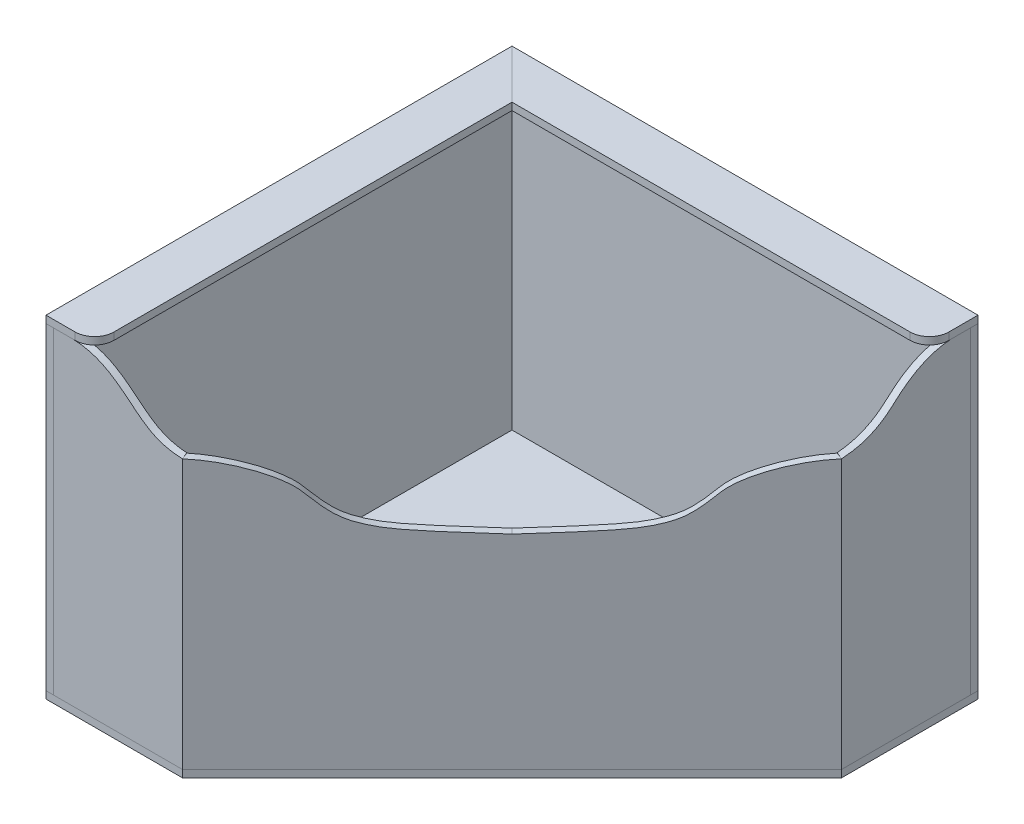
ISO-10303-21;
HEADER;
FILE_DESCRIPTION(('STEP AP214'),'2;1');
FILE_NAME('part.step','',(''),(''),'','','');
FILE_SCHEMA(('AUTOMOTIVE_DESIGN { 1 0 10303 214 1 1 1 1 }'));
ENDSEC;
DATA;
#1=APPLICATION_CONTEXT('core data for automotive mechanical design processes');
#2=APPLICATION_PROTOCOL_DEFINITION('international standard','automotive_design',2000,#1);
#3=PRODUCT_CONTEXT('',#1,'mechanical');
#4=PRODUCT('Part','Part','',(#3));
#5=PRODUCT_RELATED_PRODUCT_CATEGORY('part','',(#4));
#6=PRODUCT_DEFINITION_FORMATION('','',#4);
#7=PRODUCT_DEFINITION_CONTEXT('part definition',#1,'design');
#8=PRODUCT_DEFINITION('design','',#6,#7);
#9=PRODUCT_DEFINITION_SHAPE('','',#8);
#10=(LENGTH_UNIT() NAMED_UNIT(*) SI_UNIT(.MILLI.,.METRE.));
#11=(NAMED_UNIT(*) PLANE_ANGLE_UNIT() SI_UNIT($,.RADIAN.));
#12=(NAMED_UNIT(*) SI_UNIT($,.STERADIAN.) SOLID_ANGLE_UNIT());
#13=UNCERTAINTY_MEASURE_WITH_UNIT(LENGTH_MEASURE(1.E-05),#10,'distance_accuracy_value','');
#14=(GEOMETRIC_REPRESENTATION_CONTEXT(3) GLOBAL_UNCERTAINTY_ASSIGNED_CONTEXT((#13)) GLOBAL_UNIT_ASSIGNED_CONTEXT((#10,
#11,#12)) REPRESENTATION_CONTEXT('',''));
#15=CARTESIAN_POINT('',(0.,0.,0.));
#16=DIRECTION('',(0.,0.,1.));
#17=DIRECTION('',(1.,0.,0.));
#18=AXIS2_PLACEMENT_3D('',#15,#16,#17);
#19=CARTESIAN_POINT('',(76.1999999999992,850.9,0.));
#20=DIRECTION('',(0.,0.,-1.));
#21=DIRECTION('',(-1.,0.,0.));
#22=AXIS2_PLACEMENT_3D('',#19,#20,#21);
#23=PLANE('',#22);
#24=DIRECTION('',(1.,0.,0.));
#25=VECTOR('',#24,1.);
#26=CARTESIAN_POINT('',(76.1999999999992,831.85,0.));
#27=LINE('',#26,#25);
#28=CARTESIAN_POINT('',(0.,831.85,0.));
#29=VERTEX_POINT('',#28);
#30=CARTESIAN_POINT('',(76.1999999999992,831.85,0.));
#31=VERTEX_POINT('',#30);
#32=EDGE_CURVE('E124',#29,#31,#27,.T.);
#33=ORIENTED_EDGE('',*,*,#32,.T.);
#34=DIRECTION('',(0.,-1.,0.));
#35=VECTOR('',#34,1.);
#36=CARTESIAN_POINT('',(76.1999999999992,850.9,0.));
#37=LINE('',#36,#35);
#38=CARTESIAN_POINT('',(76.1999999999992,850.9,0.));
#39=VERTEX_POINT('',#38);
#40=EDGE_CURVE('E12',#39,#31,#37,.T.);
#41=ORIENTED_EDGE('',*,*,#40,.F.);
#42=DIRECTION('',(1.,0.,0.));
#43=VECTOR('',#42,1.);
#44=CARTESIAN_POINT('',(76.1999999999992,850.9,0.));
#45=LINE('',#44,#43);
#46=CARTESIAN_POINT('',(0.,850.9,0.));
#47=VERTEX_POINT('',#46);
#48=EDGE_CURVE('E132',#47,#39,#45,.T.);
#49=ORIENTED_EDGE('',*,*,#48,.F.);
#50=DIRECTION('',(0.,-1.,0.));
#51=VECTOR('',#50,1.);
#52=CARTESIAN_POINT('',(0.,850.9,0.));
#53=LINE('',#52,#51);
#54=EDGE_CURVE('E120',#47,#29,#53,.T.);
#55=ORIENTED_EDGE('',*,*,#54,.T.);
#56=EDGE_LOOP('',(#33,#41,#49,#55));
#57=FACE_BOUND('',#56,.T.);
#58=ADVANCED_FACE('F50',(#57),#23,.F.);
#59=CARTESIAN_POINT('',(76.1999999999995,850.9,-50.8));
#60=DIRECTION('',(0.,-1.,0.));
#61=DIRECTION('',(0.,0.,-1.));
#62=AXIS2_PLACEMENT_3D('',#59,#60,#61);
#63=CYLINDRICAL_SURFACE('',#62,50.8);
#64=CARTESIAN_POINT('',(76.1999999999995,831.85,-50.8));
#65=DIRECTION('',(0.,1.,0.));
#66=DIRECTION('',(0.,0.,-1.));
#67=AXIS2_PLACEMENT_3D('',#64,#65,#66);
#68=CIRCLE('',#67,50.8);
#69=CARTESIAN_POINT('',(127.,831.85,-50.8000000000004));
#70=VERTEX_POINT('',#69);
#71=EDGE_CURVE('E127',#31,#70,#68,.T.);
#72=ORIENTED_EDGE('',*,*,#71,.T.);
#73=DIRECTION('',(0.,-1.,0.));
#74=VECTOR('',#73,1.);
#75=CARTESIAN_POINT('',(127.,850.9,-50.8000000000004));
#76=LINE('',#75,#74);
#77=CARTESIAN_POINT('',(127.,850.9,-50.8000000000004));
#78=VERTEX_POINT('',#77);
#79=EDGE_CURVE('E58',#78,#70,#76,.T.);
#80=ORIENTED_EDGE('',*,*,#79,.F.);
#81=CARTESIAN_POINT('',(76.1999999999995,850.9,-50.8));
#82=DIRECTION('',(0.,1.,0.));
#83=DIRECTION('',(0.,0.,-1.));
#84=AXIS2_PLACEMENT_3D('',#81,#82,#83);
#85=CIRCLE('',#84,50.8);
#86=EDGE_CURVE('E100',#39,#78,#85,.T.);
#87=ORIENTED_EDGE('',*,*,#86,.F.);
#88=ORIENTED_EDGE('',*,*,#40,.T.);
#89=EDGE_LOOP('',(#72,#80,#87,#88));
#90=FACE_BOUND('',#89,.T.);
#91=ADVANCED_FACE('F151',(#90),#63,.T.);
#92=CARTESIAN_POINT('',(127.,850.9,-1092.2));
#93=DIRECTION('',(-1.,0.,0.));
#94=DIRECTION('',(0.,0.,1.));
#95=AXIS2_PLACEMENT_3D('',#92,#93,#94);
#96=PLANE('',#95);
#97=DIRECTION('',(0.,0.,-1.));
#98=VECTOR('',#97,1.);
#99=CARTESIAN_POINT('',(127.,831.85,-1092.2));
#100=LINE('',#99,#98);
#101=CARTESIAN_POINT('',(127.,831.85,-1092.2));
#102=VERTEX_POINT('',#101);
#103=EDGE_CURVE('E115',#70,#102,#100,.T.);
#104=ORIENTED_EDGE('',*,*,#103,.T.);
#105=DIRECTION('',(0.,-1.,0.));
#106=VECTOR('',#105,1.);
#107=CARTESIAN_POINT('',(127.,850.9,-1092.2));
#108=LINE('',#107,#106);
#109=CARTESIAN_POINT('',(127.,850.9,-1092.2));
#110=VERTEX_POINT('',#109);
#111=EDGE_CURVE('E112',#110,#102,#108,.T.);
#112=ORIENTED_EDGE('',*,*,#111,.F.);
#113=DIRECTION('',(0.,0.,-1.));
#114=VECTOR('',#113,1.);
#115=CARTESIAN_POINT('',(127.,850.9,-1092.2));
#116=LINE('',#115,#114);
#117=EDGE_CURVE('E104',#78,#110,#116,.T.);
#118=ORIENTED_EDGE('',*,*,#117,.F.);
#119=ORIENTED_EDGE('',*,*,#79,.T.);
#120=EDGE_LOOP('',(#104,#112,#118,#119));
#121=FACE_BOUND('',#120,.T.);
#122=ADVANCED_FACE('F113',(#121),#96,.F.);
#123=CARTESIAN_POINT('',(0.,850.9,-1219.2));
#124=DIRECTION('',(-0.707106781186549,0.,0.707106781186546));
#125=DIRECTION('',(0.707106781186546,0.,0.707106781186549));
#126=AXIS2_PLACEMENT_3D('',#123,#124,#125);
#127=PLANE('',#126);
#128=DIRECTION('',(-0.707106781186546,0.,-0.707106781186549));
#129=VECTOR('',#128,1.);
#130=CARTESIAN_POINT('',(0.,831.85,-1219.2));
#131=LINE('',#130,#129);
#132=CARTESIAN_POINT('',(0.,831.85,-1219.2));
#133=VERTEX_POINT('',#132);
#134=EDGE_CURVE('E86',#102,#133,#131,.T.);
#135=ORIENTED_EDGE('',*,*,#134,.T.);
#136=DIRECTION('',(0.,-1.,0.));
#137=VECTOR('',#136,1.);
#138=CARTESIAN_POINT('',(0.,850.9,-1219.2));
#139=LINE('',#138,#137);
#140=CARTESIAN_POINT('',(0.,850.9,-1219.2));
#141=VERTEX_POINT('',#140);
#142=EDGE_CURVE('E116',#141,#133,#139,.T.);
#143=ORIENTED_EDGE('',*,*,#142,.F.);
#144=DIRECTION('',(-0.707106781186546,0.,-0.707106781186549));
#145=VECTOR('',#144,1.);
#146=CARTESIAN_POINT('',(0.,850.9,-1219.2));
#147=LINE('',#146,#145);
#148=EDGE_CURVE('E108',#110,#141,#147,.T.);
#149=ORIENTED_EDGE('',*,*,#148,.F.);
#150=ORIENTED_EDGE('',*,*,#111,.T.);
#151=EDGE_LOOP('',(#135,#143,#149,#150));
#152=FACE_BOUND('',#151,.T.);
#153=ADVANCED_FACE('F118',(#152),#127,.F.);
#154=CARTESIAN_POINT('',(0.,850.9,0.));
#155=DIRECTION('',(1.,0.,0.));
#156=DIRECTION('',(0.,0.,-1.));
#157=AXIS2_PLACEMENT_3D('',#154,#155,#156);
#158=PLANE('',#157);
#159=DIRECTION('',(0.,0.,1.));
#160=VECTOR('',#159,1.);
#161=CARTESIAN_POINT('',(0.,831.85,0.));
#162=LINE('',#161,#160);
#163=EDGE_CURVE('E92',#133,#29,#162,.T.);
#164=ORIENTED_EDGE('',*,*,#163,.T.);
#165=ORIENTED_EDGE('',*,*,#54,.F.);
#166=DIRECTION('',(0.,0.,1.));
#167=VECTOR('',#166,1.);
#168=CARTESIAN_POINT('',(0.,850.9,0.));
#169=LINE('',#168,#167);
#170=EDGE_CURVE('E66',#141,#47,#169,.T.);
#171=ORIENTED_EDGE('',*,*,#170,.F.);
#172=ORIENTED_EDGE('',*,*,#142,.T.);
#173=EDGE_LOOP('',(#164,#165,#171,#172));
#174=FACE_BOUND('',#173,.T.);
#175=ADVANCED_FACE('F140',(#174),#158,.F.);
#176=CARTESIAN_POINT('',(76.1999999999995,850.9,-50.8));
#177=DIRECTION('',(0.,-1.,0.));
#178=DIRECTION('',(0.,0.,-1.));
#179=AXIS2_PLACEMENT_3D('',#176,#177,#178);
#180=PLANE('',#179);
#181=ORIENTED_EDGE('',*,*,#48,.T.);
#182=ORIENTED_EDGE('',*,*,#86,.T.);
#183=ORIENTED_EDGE('',*,*,#117,.T.);
#184=ORIENTED_EDGE('',*,*,#148,.T.);
#185=ORIENTED_EDGE('',*,*,#170,.T.);
#186=EDGE_LOOP('',(#181,#182,#183,#184,#185));
#187=FACE_BOUND('',#186,.T.);
#188=ADVANCED_FACE('F106',(#187),#180,.F.);
#189=CARTESIAN_POINT('',(76.1999999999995,831.85,-50.8));
#190=DIRECTION('',(0.,-1.,0.));
#191=DIRECTION('',(0.,0.,-1.));
#192=AXIS2_PLACEMENT_3D('',#189,#190,#191);
#193=PLANE('',#192);
#194=ORIENTED_EDGE('',*,*,#32,.F.);
#195=ORIENTED_EDGE('',*,*,#163,.F.);
#196=ORIENTED_EDGE('',*,*,#134,.F.);
#197=ORIENTED_EDGE('',*,*,#103,.F.);
#198=ORIENTED_EDGE('',*,*,#71,.F.);
#199=EDGE_LOOP('',(#194,#195,#196,#197,#198));
#200=FACE_BOUND('',#199,.T.);
#201=ADVANCED_FACE('F136',(#200),#193,.T.);
#202=CLOSED_SHELL('',(#58,#91,#122,#153,#175,#188,#201));
#203=MANIFOLD_SOLID_BREP('B2',#202);
#204=CARTESIAN_POINT('',(0.,850.9,-1219.2));
#205=DIRECTION('',(0.,0.,1.));
#206=DIRECTION('',(1.,0.,0.));
#207=AXIS2_PLACEMENT_3D('',#204,#205,#206);
#208=PLANE('',#207);
#209=DIRECTION('',(-1.,0.,0.));
#210=VECTOR('',#209,1.);
#211=CARTESIAN_POINT('',(0.,831.85,-1219.2));
#212=LINE('',#211,#210);
#213=CARTESIAN_POINT('',(1219.2,831.85,-1219.2));
#214=VERTEX_POINT('',#213);
#215=CARTESIAN_POINT('',(0.,831.85,-1219.2));
#216=VERTEX_POINT('',#215);
#217=EDGE_CURVE('E284',#214,#216,#212,.T.);
#218=ORIENTED_EDGE('',*,*,#217,.T.);
#219=DIRECTION('',(0.,-1.,0.));
#220=VECTOR('',#219,1.);
#221=CARTESIAN_POINT('',(0.,850.9,-1219.2));
#222=LINE('',#221,#220);
#223=CARTESIAN_POINT('',(0.,850.9,-1219.2));
#224=VERTEX_POINT('',#223);
#225=EDGE_CURVE('E48',#224,#216,#222,.T.);
#226=ORIENTED_EDGE('',*,*,#225,.F.);
#227=DIRECTION('',(-1.,0.,0.));
#228=VECTOR('',#227,1.);
#229=CARTESIAN_POINT('',(0.,850.9,-1219.2));
#230=LINE('',#229,#228);
#231=CARTESIAN_POINT('',(1219.2,850.9,-1219.2));
#232=VERTEX_POINT('',#231);
#233=EDGE_CURVE('E292',#232,#224,#230,.T.);
#234=ORIENTED_EDGE('',*,*,#233,.F.);
#235=DIRECTION('',(0.,-1.,0.));
#236=VECTOR('',#235,1.);
#237=CARTESIAN_POINT('',(1219.2,850.9,-1219.2));
#238=LINE('',#237,#236);
#239=EDGE_CURVE('E280',#232,#214,#238,.T.);
#240=ORIENTED_EDGE('',*,*,#239,.T.);
#241=EDGE_LOOP('',(#218,#226,#234,#240));
#242=FACE_BOUND('',#241,.T.);
#243=ADVANCED_FACE('F210',(#242),#208,.F.);
#244=CARTESIAN_POINT('',(0.,850.9,-1219.2));
#245=DIRECTION('',(0.707106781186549,0.,-0.707106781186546));
#246=DIRECTION('',(-0.707106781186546,0.,-0.707106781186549));
#247=AXIS2_PLACEMENT_3D('',#244,#245,#246);
#248=PLANE('',#247);
#249=DIRECTION('',(0.707106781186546,0.,0.707106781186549));
#250=VECTOR('',#249,1.);
#251=CARTESIAN_POINT('',(0.,831.85,-1219.2));
#252=LINE('',#251,#250);
#253=CARTESIAN_POINT('',(127.,831.85,-1092.2));
#254=VERTEX_POINT('',#253);
#255=EDGE_CURVE('E287',#216,#254,#252,.T.);
#256=ORIENTED_EDGE('',*,*,#255,.T.);
#257=DIRECTION('',(0.,-1.,0.));
#258=VECTOR('',#257,1.);
#259=CARTESIAN_POINT('',(127.,850.9,-1092.2));
#260=LINE('',#259,#258);
#261=CARTESIAN_POINT('',(127.,850.9,-1092.2));
#262=VERTEX_POINT('',#261);
#263=EDGE_CURVE('E218',#262,#254,#260,.T.);
#264=ORIENTED_EDGE('',*,*,#263,.F.);
#265=DIRECTION('',(0.707106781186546,0.,0.707106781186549));
#266=VECTOR('',#265,1.);
#267=CARTESIAN_POINT('',(0.,850.9,-1219.2));
#268=LINE('',#267,#266);
#269=EDGE_CURVE('E260',#224,#262,#268,.T.);
#270=ORIENTED_EDGE('',*,*,#269,.F.);
#271=ORIENTED_EDGE('',*,*,#225,.T.);
#272=EDGE_LOOP('',(#256,#264,#270,#271));
#273=FACE_BOUND('',#272,.T.);
#274=ADVANCED_FACE('F311',(#273),#248,.F.);
#275=CARTESIAN_POINT('',(127.,850.9,-1092.2));
#276=DIRECTION('',(0.,0.,-1.));
#277=DIRECTION('',(-1.,0.,0.));
#278=AXIS2_PLACEMENT_3D('',#275,#276,#277);
#279=PLANE('',#278);
#280=DIRECTION('',(1.,0.,0.));
#281=VECTOR('',#280,1.);
#282=CARTESIAN_POINT('',(127.,831.85,-1092.2));
#283=LINE('',#282,#281);
#284=CARTESIAN_POINT('',(1168.4,831.85,-1092.2));
#285=VERTEX_POINT('',#284);
#286=EDGE_CURVE('E275',#254,#285,#283,.T.);
#287=ORIENTED_EDGE('',*,*,#286,.T.);
#288=DIRECTION('',(0.,-1.,0.));
#289=VECTOR('',#288,1.);
#290=CARTESIAN_POINT('',(1168.4,850.9,-1092.2));
#291=LINE('',#290,#289);
#292=CARTESIAN_POINT('',(1168.4,850.9,-1092.2));
#293=VERTEX_POINT('',#292);
#294=EDGE_CURVE('E272',#293,#285,#291,.T.);
#295=ORIENTED_EDGE('',*,*,#294,.F.);
#296=DIRECTION('',(1.,0.,0.));
#297=VECTOR('',#296,1.);
#298=CARTESIAN_POINT('',(127.,850.9,-1092.2));
#299=LINE('',#298,#297);
#300=EDGE_CURVE('E264',#262,#293,#299,.T.);
#301=ORIENTED_EDGE('',*,*,#300,.F.);
#302=ORIENTED_EDGE('',*,*,#263,.T.);
#303=EDGE_LOOP('',(#287,#295,#301,#302));
#304=FACE_BOUND('',#303,.T.);
#305=ADVANCED_FACE('F273',(#304),#279,.F.);
#306=CARTESIAN_POINT('',(1168.4,850.9,-1143.));
#307=DIRECTION('',(0.,-1.,0.));
#308=DIRECTION('',(0.,0.,-1.));
#309=AXIS2_PLACEMENT_3D('',#306,#307,#308);
#310=CYLINDRICAL_SURFACE('',#309,50.8);
#311=CARTESIAN_POINT('',(1168.4,831.85,-1143.));
#312=DIRECTION('',(0.,1.,0.));
#313=DIRECTION('',(0.,0.,1.));
#314=AXIS2_PLACEMENT_3D('',#311,#312,#313);
#315=CIRCLE('',#314,50.8);
#316=CARTESIAN_POINT('',(1219.2,831.85,-1143.));
#317=VERTEX_POINT('',#316);
#318=EDGE_CURVE('E246',#285,#317,#315,.T.);
#319=ORIENTED_EDGE('',*,*,#318,.T.);
#320=DIRECTION('',(0.,-1.,0.));
#321=VECTOR('',#320,1.);
#322=CARTESIAN_POINT('',(1219.2,850.9,-1143.));
#323=LINE('',#322,#321);
#324=CARTESIAN_POINT('',(1219.2,850.9,-1143.));
#325=VERTEX_POINT('',#324);
#326=EDGE_CURVE('E276',#325,#317,#323,.T.);
#327=ORIENTED_EDGE('',*,*,#326,.F.);
#328=CARTESIAN_POINT('',(1168.4,850.9,-1143.));
#329=DIRECTION('',(0.,1.,0.));
#330=DIRECTION('',(0.,0.,1.));
#331=AXIS2_PLACEMENT_3D('',#328,#329,#330);
#332=CIRCLE('',#331,50.8);
#333=EDGE_CURVE('E268',#293,#325,#332,.T.);
#334=ORIENTED_EDGE('',*,*,#333,.F.);
#335=ORIENTED_EDGE('',*,*,#294,.T.);
#336=EDGE_LOOP('',(#319,#327,#334,#335));
#337=FACE_BOUND('',#336,.T.);
#338=ADVANCED_FACE('F278',(#337),#310,.T.);
#339=CARTESIAN_POINT('',(1219.2,850.9,-1143.));
#340=DIRECTION('',(-1.,0.,0.));
#341=DIRECTION('',(0.,0.,1.));
#342=AXIS2_PLACEMENT_3D('',#339,#340,#341);
#343=PLANE('',#342);
#344=DIRECTION('',(0.,0.,-1.));
#345=VECTOR('',#344,1.);
#346=CARTESIAN_POINT('',(1219.2,831.85,-1143.));
#347=LINE('',#346,#345);
#348=EDGE_CURVE('E252',#317,#214,#347,.T.);
#349=ORIENTED_EDGE('',*,*,#348,.T.);
#350=ORIENTED_EDGE('',*,*,#239,.F.);
#351=DIRECTION('',(0.,0.,-1.));
#352=VECTOR('',#351,1.);
#353=CARTESIAN_POINT('',(1219.2,850.9,-1143.));
#354=LINE('',#353,#352);
#355=EDGE_CURVE('E226',#325,#232,#354,.T.);
#356=ORIENTED_EDGE('',*,*,#355,.F.);
#357=ORIENTED_EDGE('',*,*,#326,.T.);
#358=EDGE_LOOP('',(#349,#350,#356,#357));
#359=FACE_BOUND('',#358,.T.);
#360=ADVANCED_FACE('F300',(#359),#343,.F.);
#361=CARTESIAN_POINT('',(1168.4,850.9,-1143.));
#362=DIRECTION('',(0.,1.,0.));
#363=DIRECTION('',(0.,0.,1.));
#364=AXIS2_PLACEMENT_3D('',#361,#362,#363);
#365=PLANE('',#364);
#366=ORIENTED_EDGE('',*,*,#233,.T.);
#367=ORIENTED_EDGE('',*,*,#269,.T.);
#368=ORIENTED_EDGE('',*,*,#300,.T.);
#369=ORIENTED_EDGE('',*,*,#333,.T.);
#370=ORIENTED_EDGE('',*,*,#355,.T.);
#371=EDGE_LOOP('',(#366,#367,#368,#369,#370));
#372=FACE_BOUND('',#371,.T.);
#373=ADVANCED_FACE('F266',(#372),#365,.T.);
#374=CARTESIAN_POINT('',(1168.4,831.85,-1143.));
#375=DIRECTION('',(0.,1.,0.));
#376=DIRECTION('',(0.,0.,1.));
#377=AXIS2_PLACEMENT_3D('',#374,#375,#376);
#378=PLANE('',#377);
#379=ORIENTED_EDGE('',*,*,#217,.F.);
#380=ORIENTED_EDGE('',*,*,#348,.F.);
#381=ORIENTED_EDGE('',*,*,#318,.F.);
#382=ORIENTED_EDGE('',*,*,#286,.F.);
#383=ORIENTED_EDGE('',*,*,#255,.F.);
#384=EDGE_LOOP('',(#379,#380,#381,#382,#383));
#385=FACE_BOUND('',#384,.T.);
#386=ADVANCED_FACE('F296',(#385),#378,.F.);
#387=CLOSED_SHELL('',(#243,#274,#305,#338,#360,#373,#386));
#388=MANIFOLD_SOLID_BREP('B6',#387);
#389=CARTESIAN_POINT('',(0.,0.,0.));
#390=DIRECTION('',(0.,-1.,0.));
#391=DIRECTION('',(0.,0.,-1.));
#392=AXIS2_PLACEMENT_3D('',#389,#390,#391);
#393=PLANE('',#392);
#394=DIRECTION('',(0.707106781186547,0.,-0.707106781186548));
#395=VECTOR('',#394,1.);
#396=CARTESIAN_POINT('',(1219.2,0.,-862.059231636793));
#397=LINE('',#396,#395);
#398=CARTESIAN_POINT('',(357.140768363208,0.,0.));
#399=VERTEX_POINT('',#398);
#400=CARTESIAN_POINT('',(1219.2,0.,-862.059231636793));
#401=VERTEX_POINT('',#400);
#402=EDGE_CURVE('E435',#399,#401,#397,.T.);
#403=ORIENTED_EDGE('',*,*,#402,.F.);
#404=DIRECTION('',(0.382692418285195,0.,0.923875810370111));
#405=VECTOR('',#404,1.);
#406=CARTESIAN_POINT('',(357.140768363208,0.,0.));
#407=LINE('',#406,#405);
#408=CARTESIAN_POINT('',(349.249846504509,0.,-19.0498465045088));
#409=VERTEX_POINT('',#408);
#410=EDGE_CURVE('E451',#409,#399,#407,.T.);
#411=ORIENTED_EDGE('',*,*,#410,.F.);
#412=DIRECTION('',(-0.707106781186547,0.,0.707106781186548));
#413=VECTOR('',#412,1.);
#414=CARTESIAN_POINT('',(349.249846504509,0.,-19.0498465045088));
#415=LINE('',#414,#413);
#416=CARTESIAN_POINT('',(1200.15,0.,-869.95));
#417=VERTEX_POINT('',#416);
#418=EDGE_CURVE('E437',#417,#409,#415,.T.);
#419=ORIENTED_EDGE('',*,*,#418,.F.);
#420=DIRECTION('',(-0.923879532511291,0.,-0.38268343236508));
#421=VECTOR('',#420,1.);
#422=CARTESIAN_POINT('',(1200.15,0.,-869.95));
#423=LINE('',#422,#421);
#424=EDGE_CURVE('E426',#401,#417,#423,.T.);
#425=ORIENTED_EDGE('',*,*,#424,.F.);
#426=EDGE_LOOP('',(#403,#411,#419,#425));
#427=FACE_BOUND('',#426,.T.);
#428=ADVANCED_FACE('F370',(#427),#393,.T.);
#429=CARTESIAN_POINT('',(357.140768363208,831.851,0.));
#430=DIRECTION('',(0.923875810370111,0.,-0.382692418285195));
#431=DIRECTION('',(-0.382692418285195,0.,-0.923875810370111));
#432=AXIS2_PLACEMENT_3D('',#429,#430,#431);
#433=PLANE('',#432);
#434=DIRECTION('',(0.,-1.,0.));
#435=VECTOR('',#434,1.);
#436=CARTESIAN_POINT('',(357.140768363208,831.851,0.));
#437=LINE('',#436,#435);
#438=CARTESIAN_POINT('',(357.140768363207,703.815722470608,3.33066907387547E-13));
#439=VERTEX_POINT('',#438);
#440=EDGE_CURVE('E440',#439,#399,#437,.T.);
#441=ORIENTED_EDGE('',*,*,#440,.F.);
#442=CARTESIAN_POINT('',(357.140768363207,703.815722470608,1.66533453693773E-13));
#443=CARTESIAN_POINT('',(356.70234410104,703.797160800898,-1.05842068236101));
#444=CARTESIAN_POINT('',(356.263925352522,703.777712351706,-2.11682805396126));
#445=CARTESIAN_POINT('',(355.38710169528,703.737065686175,-4.23360938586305));
#446=CARTESIAN_POINT('',(354.948696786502,703.715867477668,-5.29198334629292));
#447=CARTESIAN_POINT('',(354.071900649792,703.671744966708,-7.40869823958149));
#448=CARTESIAN_POINT('',(353.633509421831,703.648820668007,-8.46703917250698));
#449=CARTESIAN_POINT('',(352.75674053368,703.6012686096,-10.583688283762));
#450=CARTESIAN_POINT('',(352.318362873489,703.576640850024,-11.6419964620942));
#451=CARTESIAN_POINT('',(351.44162087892,703.525703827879,-13.758580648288));
#452=CARTESIAN_POINT('',(351.003256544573,703.499394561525,-14.8168566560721));
#453=CARTESIAN_POINT('',(350.126541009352,703.44511553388,-16.933376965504));
#454=CARTESIAN_POINT('',(349.688189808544,703.417145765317,-17.9916212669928));
#455=CARTESIAN_POINT('',(349.249846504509,703.388356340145,-19.0498465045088));
#456=B_SPLINE_CURVE_WITH_KNOTS('',3,(#442,#443,#444,#445,#446,#447,#448,#449,#450,#451,#452,
#453,#454,#455),.UNSPECIFIED.,.F.,.F.,(4,2,2,2,2,2,4),(0.,3.43734339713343,6.87467141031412,
10.3119919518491,13.7493122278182,17.1866402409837,20.6239833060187),.UNSPECIFIED.);
#457=CARTESIAN_POINT('',(349.249846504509,703.388356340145,-19.0498465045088));
#458=VERTEX_POINT('',#457);
#459=EDGE_CURVE('E391',#439,#458,#456,.T.);
#460=ORIENTED_EDGE('',*,*,#459,.T.);
#461=DIRECTION('',(0.,-1.,0.));
#462=VECTOR('',#461,1.);
#463=CARTESIAN_POINT('',(349.249846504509,831.851,-19.0498465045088));
#464=LINE('',#463,#462);
#465=EDGE_CURVE('E454',#458,#409,#464,.T.);
#466=ORIENTED_EDGE('',*,*,#465,.T.);
#467=ORIENTED_EDGE('',*,*,#410,.T.);
#468=EDGE_LOOP('',(#441,#460,#466,#467));
#469=FACE_BOUND('',#468,.T.);
#470=ADVANCED_FACE('F467',(#469),#433,.F.);
#471=CARTESIAN_POINT('',(349.249846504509,831.851,-19.0498465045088));
#472=DIRECTION('',(0.707106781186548,0.,0.707106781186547));
#473=DIRECTION('',(0.707106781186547,0.,-0.707106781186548));
#474=AXIS2_PLACEMENT_3D('',#471,#472,#473);
#475=PLANE('',#474);
#476=CARTESIAN_POINT('',(774.7,533.4,-444.5));
#477=CARTESIAN_POINT('',(653.950794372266,539.913589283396,-323.750794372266));
#478=CARTESIAN_POINT('',(612.340179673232,544.516452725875,-282.140179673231));
#479=CARTESIAN_POINT('',(558.515425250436,564.719403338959,-228.315425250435));
#480=CARTESIAN_POINT('',(534.686866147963,581.475854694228,-204.486866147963));
#481=CARTESIAN_POINT('',(476.72721654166,665.034466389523,-146.52721654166));
#482=CARTESIAN_POINT('',(395.00368039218,700.742078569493,-64.8036803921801));
#483=CARTESIAN_POINT('',(343.670384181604,703.815722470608,-13.4703841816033));
#484=B_SPLINE_CURVE_WITH_KNOTS('',3,(#476,#477,#478,#479,#480,#481,#482,#483),.UNSPECIFIED.,.F.,
.F.,(4,1,1,1,1,4),(0.,0.332635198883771,0.406350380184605,0.700396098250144,0.763436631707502,
1.),.UNSPECIFIED.);
#485=CARTESIAN_POINT('',(774.7,533.4,-444.500000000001));
#486=VERTEX_POINT('',#485);
#487=EDGE_CURVE('E463',#458,#486,#484,.F.);
#488=ORIENTED_EDGE('',*,*,#487,.T.);
#489=CARTESIAN_POINT('',(1205.7296158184,703.815722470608,-875.529615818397));
#490=CARTESIAN_POINT('',(1154.39631960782,700.742078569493,-824.19631960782));
#491=CARTESIAN_POINT('',(1072.67278345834,665.034466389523,-742.47278345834));
#492=CARTESIAN_POINT('',(1014.71313385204,581.475854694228,-684.513133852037));
#493=CARTESIAN_POINT('',(990.884574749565,564.719403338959,-660.684574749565));
#494=CARTESIAN_POINT('',(937.059820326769,544.516452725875,-606.859820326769));
#495=CARTESIAN_POINT('',(895.449205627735,539.913589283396,-565.249205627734));
#496=CARTESIAN_POINT('',(774.7,533.4,-444.5));
#497=B_SPLINE_CURVE_WITH_KNOTS('',3,(#489,#490,#491,#492,#493,#494,#495,#496),.UNSPECIFIED.,.F.,
.F.,(4,1,1,1,1,4),(0.,0.236563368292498,0.299603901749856,0.593649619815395,0.667364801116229,
1.),.UNSPECIFIED.);
#498=CARTESIAN_POINT('',(1200.14999999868,703.388342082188,-869.949999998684));
#499=VERTEX_POINT('',#498);
#500=EDGE_CURVE('E464',#486,#499,#497,.F.);
#501=ORIENTED_EDGE('',*,*,#500,.T.);
#502=DIRECTION('',(0.,-1.,0.));
#503=VECTOR('',#502,1.);
#504=CARTESIAN_POINT('',(1200.15,831.851,-869.95));
#505=LINE('',#504,#503);
#506=EDGE_CURVE('E430',#499,#417,#505,.T.);
#507=ORIENTED_EDGE('',*,*,#506,.T.);
#508=ORIENTED_EDGE('',*,*,#418,.T.);
#509=ORIENTED_EDGE('',*,*,#465,.F.);
#510=EDGE_LOOP('',(#488,#501,#507,#508,#509));
#511=FACE_BOUND('',#510,.T.);
#512=ADVANCED_FACE('F505',(#511),#475,.F.);
#513=CARTESIAN_POINT('',(1200.15,831.851,-869.95));
#514=DIRECTION('',(-0.38268343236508,0.,0.923879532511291));
#515=DIRECTION('',(0.923879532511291,0.,0.38268343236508));
#516=AXIS2_PLACEMENT_3D('',#513,#514,#515);
#517=PLANE('',#516);
#518=ORIENTED_EDGE('',*,*,#506,.F.);
#519=CARTESIAN_POINT('',(1200.15,703.388342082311,-869.95));
#520=CARTESIAN_POINT('',(1201.20823375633,703.417132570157,-869.511665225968));
#521=CARTESIAN_POINT('',(1202.26648657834,703.445103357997,-869.07332255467));
#522=CARTESIAN_POINT('',(1204.38302393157,703.499384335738,-868.196624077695));
#523=CARTESIAN_POINT('',(1205.44130846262,703.525694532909,-867.758268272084));
#524=CARTESIAN_POINT('',(1207.55790969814,703.576633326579,-866.881543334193));
#525=CARTESIAN_POINT('',(1208.61622640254,703.601261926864,-866.443174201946));
#526=CARTESIAN_POINT('',(1210.73289256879,703.648815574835,-865.56642236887));
#527=CARTESIAN_POINT('',(1211.79124203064,703.671740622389,-865.128039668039));
#528=CARTESIAN_POINT('',(1213.90797398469,703.715864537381,-864.251260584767));
#529=CARTESIAN_POINT('',(1214.96635647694,703.737063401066,-863.812864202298));
#530=CARTESIAN_POINT('',(1217.08315487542,703.777711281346,-862.936057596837));
#531=CARTESIAN_POINT('',(1218.14157078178,703.797160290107,-862.497647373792));
#532=CARTESIAN_POINT('',(1219.2,703.815722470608,-862.059231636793));
#533=B_SPLINE_CURVE_WITH_KNOTS('',3,(#519,#520,#521,#522,#523,#524,#525,#526,#527,#528,#529,
#530,#531,#532),.UNSPECIFIED.,.F.,.F.,(4,2,2,2,2,2,4),(0.,3.43735695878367,6.87469886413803,
10.3120330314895,13.7493674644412,17.1867093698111,20.6240666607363),.UNSPECIFIED.);
#534=CARTESIAN_POINT('',(1219.2,703.815722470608,-862.059231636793));
#535=VERTEX_POINT('',#534);
#536=EDGE_CURVE('E406',#499,#535,#533,.T.);
#537=ORIENTED_EDGE('',*,*,#536,.T.);
#538=DIRECTION('',(0.,-1.,0.));
#539=VECTOR('',#538,1.);
#540=CARTESIAN_POINT('',(1219.2,831.851,-862.059231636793));
#541=LINE('',#540,#539);
#542=EDGE_CURVE('E423',#535,#401,#541,.T.);
#543=ORIENTED_EDGE('',*,*,#542,.T.);
#544=ORIENTED_EDGE('',*,*,#424,.T.);
#545=EDGE_LOOP('',(#518,#537,#543,#544));
#546=FACE_BOUND('',#545,.T.);
#547=ADVANCED_FACE('F425',(#546),#517,.F.);
#548=CARTESIAN_POINT('',(1219.2,831.851,-862.059231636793));
#549=DIRECTION('',(-0.707106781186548,0.,-0.707106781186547));
#550=DIRECTION('',(-0.707106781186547,0.,0.707106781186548));
#551=AXIS2_PLACEMENT_3D('',#548,#549,#550);
#552=PLANE('',#551);
#553=ORIENTED_EDGE('',*,*,#542,.F.);
#554=CARTESIAN_POINT('',(1219.2,703.815722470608,-862.059231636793));
#555=CARTESIAN_POINT('',(1167.86670378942,700.742078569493,-810.725935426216));
#556=CARTESIAN_POINT('',(1086.14316763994,665.034466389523,-729.002399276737));
#557=CARTESIAN_POINT('',(1028.18351803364,581.475854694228,-671.042749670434));
#558=CARTESIAN_POINT('',(1004.35495893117,564.719403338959,-647.214190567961));
#559=CARTESIAN_POINT('',(950.530204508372,544.516452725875,-593.389436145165));
#560=CARTESIAN_POINT('',(908.919589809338,539.913589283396,-551.778821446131));
#561=CARTESIAN_POINT('',(788.170384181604,533.4,-431.029615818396));
#562=B_SPLINE_CURVE_WITH_KNOTS('',3,(#554,#555,#556,#557,#558,#559,#560,#561),.UNSPECIFIED.,.F.,
.F.,(4,1,1,1,1,4),(0.,0.236563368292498,0.299603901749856,0.593649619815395,0.667364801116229,
1.),.UNSPECIFIED.);
#563=CARTESIAN_POINT('',(788.170384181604,533.4,-431.029615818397));
#564=VERTEX_POINT('',#563);
#565=EDGE_CURVE('E374',#535,#564,#562,.T.);
#566=ORIENTED_EDGE('',*,*,#565,.T.);
#567=CARTESIAN_POINT('',(788.170384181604,533.4,-431.029615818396));
#568=CARTESIAN_POINT('',(667.42117855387,539.913589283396,-310.280410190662));
#569=CARTESIAN_POINT('',(625.810563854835,544.516452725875,-268.669795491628));
#570=CARTESIAN_POINT('',(571.985809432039,564.719403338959,-214.845041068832));
#571=CARTESIAN_POINT('',(548.157250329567,581.475854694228,-191.016481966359));
#572=CARTESIAN_POINT('',(490.197600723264,665.034466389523,-133.056832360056));
#573=CARTESIAN_POINT('',(408.474064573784,700.742078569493,-51.3332962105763));
#574=CARTESIAN_POINT('',(357.140768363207,703.815722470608,4.90076153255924E-13));
#575=B_SPLINE_CURVE_WITH_KNOTS('',3,(#567,#568,#569,#570,#571,#572,#573,#574),.UNSPECIFIED.,.F.,
.F.,(4,1,1,1,1,4),(0.,0.332635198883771,0.406350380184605,0.700396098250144,0.763436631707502,
1.),.UNSPECIFIED.);
#576=EDGE_CURVE('E382',#564,#439,#575,.T.);
#577=ORIENTED_EDGE('',*,*,#576,.T.);
#578=ORIENTED_EDGE('',*,*,#440,.T.);
#579=ORIENTED_EDGE('',*,*,#402,.T.);
#580=EDGE_LOOP('',(#553,#566,#577,#578,#579));
#581=FACE_BOUND('',#580,.T.);
#582=ADVANCED_FACE('F372',(#581),#552,.F.);
#583=CARTESIAN_POINT('',(1219.2,703.815722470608,-862.059231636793));
#584=CARTESIAN_POINT('',(1167.86670378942,700.742078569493,-810.725935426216));
#585=CARTESIAN_POINT('',(1086.14316763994,665.034466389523,-729.002399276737));
#586=CARTESIAN_POINT('',(1028.18351803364,581.475854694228,-671.042749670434));
#587=CARTESIAN_POINT('',(1004.35495893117,564.719403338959,-647.214190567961));
#588=CARTESIAN_POINT('',(950.530204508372,544.516452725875,-593.389436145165));
#589=CARTESIAN_POINT('',(908.919589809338,539.913589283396,-551.778821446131));
#590=CARTESIAN_POINT('',(788.170384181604,533.4,-431.029615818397));
#591=B_SPLINE_CURVE_WITH_KNOTS('',3,(#583,#584,#585,#586,#587,#588,#589,#590),.UNSPECIFIED.,.F.,
.F.,(4,1,1,1,1,4),(0.,0.236563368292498,0.299603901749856,0.593649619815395,0.667364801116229,
1.),.UNSPECIFIED.);
#592=DIRECTION('',(-0.707106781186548,0.,-0.707106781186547));
#593=VECTOR('',#592,1.);
#594=SURFACE_OF_LINEAR_EXTRUSION('',#591,#593);
#595=ORIENTED_EDGE('',*,*,#500,.F.);
#596=DIRECTION('',(-0.707106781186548,0.,-0.707106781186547));
#597=VECTOR('',#596,1.);
#598=CARTESIAN_POINT('',(788.170384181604,533.4,-431.029615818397));
#599=LINE('',#598,#597);
#600=EDGE_CURVE('E208',#564,#486,#599,.T.);
#601=ORIENTED_EDGE('',*,*,#600,.F.);
#602=ORIENTED_EDGE('',*,*,#565,.F.);
#603=ORIENTED_EDGE('',*,*,#536,.F.);
#604=EDGE_LOOP('',(#595,#601,#602,#603));
#605=FACE_BOUND('',#604,.T.);
#606=ADVANCED_FACE('F475',(#605),#594,.F.);
#607=CARTESIAN_POINT('',(788.170384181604,533.4,-431.029615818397));
#608=CARTESIAN_POINT('',(667.421178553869,539.913589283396,-310.280410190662));
#609=CARTESIAN_POINT('',(625.810563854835,544.516452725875,-268.669795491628));
#610=CARTESIAN_POINT('',(571.985809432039,564.719403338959,-214.845041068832));
#611=CARTESIAN_POINT('',(548.157250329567,581.475854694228,-191.016481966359));
#612=CARTESIAN_POINT('',(490.197600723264,665.034466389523,-133.056832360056));
#613=CARTESIAN_POINT('',(408.474064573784,700.742078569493,-51.3332962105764));
#614=CARTESIAN_POINT('',(357.140768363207,703.815722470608,3.33066907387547E-13));
#615=B_SPLINE_CURVE_WITH_KNOTS('',3,(#607,#608,#609,#610,#611,#612,#613,#614),.UNSPECIFIED.,.F.,
.F.,(4,1,1,1,1,4),(0.,0.332635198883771,0.406350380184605,0.700396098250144,0.763436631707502,
1.),.UNSPECIFIED.);
#616=DIRECTION('',(-0.707106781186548,0.,-0.707106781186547));
#617=VECTOR('',#616,1.);
#618=SURFACE_OF_LINEAR_EXTRUSION('',#615,#617);
#619=ORIENTED_EDGE('',*,*,#459,.F.);
#620=ORIENTED_EDGE('',*,*,#576,.F.);
#621=ORIENTED_EDGE('',*,*,#600,.T.);
#622=ORIENTED_EDGE('',*,*,#487,.F.);
#623=EDGE_LOOP('',(#619,#620,#621,#622));
#624=FACE_BOUND('',#623,.T.);
#625=ADVANCED_FACE('F471',(#624),#618,.F.);
#626=CLOSED_SHELL('',(#428,#470,#512,#547,#582,#606,#625));
#627=MANIFOLD_SOLID_BREP('B42',#626);
#628=CARTESIAN_POINT('',(285.75,-19.05,-260.35));
#629=DIRECTION('',(0.,1.,0.));
#630=DIRECTION('',(0.,0.,1.));
#631=AXIS2_PLACEMENT_3D('',#628,#629,#630);
#632=CYLINDRICAL_SURFACE('',#631,39.6875);
#633=CARTESIAN_POINT('',(285.75,-19.05,-260.35));
#634=DIRECTION('',(0.,-1.,0.));
#635=DIRECTION('',(0.,0.,-1.));
#636=AXIS2_PLACEMENT_3D('',#633,#634,#635);
#637=CIRCLE('',#636,39.6875);
#638=CARTESIAN_POINT('',(285.75,-19.05,-220.6625));
#639=VERTEX_POINT('',#638);
#640=EDGE_CURVE('E763',#639,#639,#637,.T.);
#641=CARTESIAN_POINT('',(285.75,-3.175,-260.35));
#642=DIRECTION('',(0.,1.,0.));
#643=DIRECTION('',(0.,0.,1.));
#644=AXIS2_PLACEMENT_3D('',#641,#642,#643);
#645=CIRCLE('',#644,39.6875);
#646=CARTESIAN_POINT('',(285.75,-3.175,-220.6625));
#647=VERTEX_POINT('',#646);
#648=EDGE_CURVE('E686',#647,#647,#645,.T.);
#649=CARTESIAN_POINT('',(285.75,-19.05,-220.6625));
#650=CARTESIAN_POINT('',(285.75,-18.8846354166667,-220.6625));
#651=CARTESIAN_POINT('',(285.75,-18.7192708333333,-220.6625));
#652=CARTESIAN_POINT('',(285.75,-18.3885416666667,-220.6625));
#653=CARTESIAN_POINT('',(285.75,-18.2231770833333,-220.6625));
#654=CARTESIAN_POINT('',(285.75,-17.8924479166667,-220.6625));
#655=CARTESIAN_POINT('',(285.75,-17.7270833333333,-220.6625));
#656=CARTESIAN_POINT('',(285.75,-17.3963541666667,-220.6625));
#657=CARTESIAN_POINT('',(285.75,-17.2309895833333,-220.6625));
#658=CARTESIAN_POINT('',(285.75,-16.9002604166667,-220.6625));
#659=CARTESIAN_POINT('',(285.75,-16.7348958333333,-220.6625));
#660=CARTESIAN_POINT('',(285.75,-16.4041666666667,-220.6625));
#661=CARTESIAN_POINT('',(285.75,-16.2388020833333,-220.6625));
#662=CARTESIAN_POINT('',(285.75,-15.9080729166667,-220.6625));
#663=CARTESIAN_POINT('',(285.75,-15.7427083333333,-220.6625));
#664=CARTESIAN_POINT('',(285.75,-15.4119791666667,-220.6625));
#665=CARTESIAN_POINT('',(285.75,-15.2466145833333,-220.6625));
#666=CARTESIAN_POINT('',(285.75,-14.9158854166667,-220.6625));
#667=CARTESIAN_POINT('',(285.75,-14.7505208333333,-220.6625));
#668=CARTESIAN_POINT('',(285.75,-14.4197916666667,-220.6625));
#669=CARTESIAN_POINT('',(285.75,-14.2544270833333,-220.6625));
#670=CARTESIAN_POINT('',(285.75,-13.9236979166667,-220.6625));
#671=CARTESIAN_POINT('',(285.75,-13.7583333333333,-220.6625));
#672=CARTESIAN_POINT('',(285.75,-13.4276041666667,-220.6625));
#673=CARTESIAN_POINT('',(285.75,-13.2622395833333,-220.6625));
#674=CARTESIAN_POINT('',(285.75,-12.9315104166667,-220.6625));
#675=CARTESIAN_POINT('',(285.75,-12.7661458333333,-220.6625));
#676=CARTESIAN_POINT('',(285.75,-12.4354166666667,-220.6625));
#677=CARTESIAN_POINT('',(285.75,-12.2700520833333,-220.6625));
#678=CARTESIAN_POINT('',(285.75,-11.9393229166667,-220.6625));
#679=CARTESIAN_POINT('',(285.75,-11.7739583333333,-220.6625));
#680=CARTESIAN_POINT('',(285.75,-11.4432291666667,-220.6625));
#681=CARTESIAN_POINT('',(285.75,-11.2778645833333,-220.6625));
#682=CARTESIAN_POINT('',(285.75,-10.9471354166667,-220.6625));
#683=CARTESIAN_POINT('',(285.75,-10.7817708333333,-220.6625));
#684=CARTESIAN_POINT('',(285.75,-10.4510416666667,-220.6625));
#685=CARTESIAN_POINT('',(285.75,-10.2856770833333,-220.6625));
#686=CARTESIAN_POINT('',(285.75,-9.95494791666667,-220.6625));
#687=CARTESIAN_POINT('',(285.75,-9.78958333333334,-220.6625));
#688=CARTESIAN_POINT('',(285.75,-9.45885416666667,-220.6625));
#689=CARTESIAN_POINT('',(285.75,-9.29348958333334,-220.6625));
#690=CARTESIAN_POINT('',(285.75,-8.96276041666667,-220.6625));
#691=CARTESIAN_POINT('',(285.75,-8.79739583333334,-220.6625));
#692=CARTESIAN_POINT('',(285.75,-8.46666666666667,-220.6625));
#693=CARTESIAN_POINT('',(285.75,-8.30130208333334,-220.6625));
#694=CARTESIAN_POINT('',(285.75,-7.97057291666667,-220.6625));
#695=CARTESIAN_POINT('',(285.75,-7.80520833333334,-220.6625));
#696=CARTESIAN_POINT('',(285.75,-7.47447916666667,-220.6625));
#697=CARTESIAN_POINT('',(285.75,-7.30911458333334,-220.6625));
#698=CARTESIAN_POINT('',(285.75,-6.97838541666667,-220.6625));
#699=CARTESIAN_POINT('',(285.75,-6.81302083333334,-220.6625));
#700=CARTESIAN_POINT('',(285.75,-6.48229166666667,-220.6625));
#701=CARTESIAN_POINT('',(285.75,-6.31692708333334,-220.6625));
#702=CARTESIAN_POINT('',(285.75,-5.98619791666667,-220.6625));
#703=CARTESIAN_POINT('',(285.75,-5.82083333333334,-220.6625));
#704=CARTESIAN_POINT('',(285.75,-5.49010416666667,-220.6625));
#705=CARTESIAN_POINT('',(285.75,-5.32473958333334,-220.6625));
#706=CARTESIAN_POINT('',(285.75,-4.99401041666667,-220.6625));
#707=CARTESIAN_POINT('',(285.75,-4.82864583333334,-220.6625));
#708=CARTESIAN_POINT('',(285.75,-4.49791666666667,-220.6625));
#709=CARTESIAN_POINT('',(285.75,-4.33255208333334,-220.6625));
#710=CARTESIAN_POINT('',(285.75,-4.00182291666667,-220.6625));
#711=CARTESIAN_POINT('',(285.75,-3.83645833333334,-220.6625));
#712=CARTESIAN_POINT('',(285.75,-3.50572916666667,-220.6625));
#713=CARTESIAN_POINT('',(285.75,-3.34036458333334,-220.6625));
#714=CARTESIAN_POINT('',(285.75,-3.175,-220.6625));
#715=B_SPLINE_CURVE_WITH_KNOTS('',3,(#649,#650,#651,#652,#653,#654,#655,#656,#657,#658,#659,
#660,#661,#662,#663,#664,#665,#666,#667,#668,#669,#670,#671,#672,#673,#674,#675,#676,#677,#678,
#679,#680,#681,#682,#683,#684,#685,#686,#687,#688,#689,#690,#691,#692,#693,#694,#695,#696,#697,
#698,#699,#700,#701,#702,#703,#704,#705,#706,#707,#708,#709,#710,#711,#712,#713,#714),
.UNSPECIFIED.,.F.,.F.,(4,2,2,2,2,2,2,2,2,2,2,2,2,2,2,2,2,2,2,2,2,2,2,2,2,2,2,2,2,2,2,2,4),(0.,
0.496093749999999,0.992187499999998,1.48828125,1.984375,2.48046875,2.9765625,3.47265625,3.96875,
4.46484375,4.9609375,5.45703125,5.953125,6.44921875,6.94531249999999,7.44140625,
7.93749999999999,8.43359374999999,8.92968749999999,9.42578124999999,9.92187499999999,
10.41796875,10.9140625,11.41015625,11.90625,12.40234375,12.8984375,13.39453125,13.890625,
14.38671875,14.8828125,15.37890625,15.875),.UNSPECIFIED.);
#716=EDGE_CURVE('BSEAM682',#639,#647,#715,.T.);
#717=ORIENTED_EDGE('',*,*,#640,.T.);
#718=ORIENTED_EDGE('',*,*,#648,.T.);
#719=ORIENTED_EDGE('',*,*,#716,.T.);
#720=ORIENTED_EDGE('',*,*,#716,.F.);
#721=EDGE_LOOP('',(#717,#719,#718,#720));
#722=FACE_BOUND('',#721,.T.);
#723=ADVANCED_FACE('F682',(#722),#632,.F.);
#724=CARTESIAN_POINT('',(0.,-19.05,0.));
#725=DIRECTION('',(0.,1.,0.));
#726=DIRECTION('',(0.,0.,1.));
#727=AXIS2_PLACEMENT_3D('',#724,#725,#726);
#728=PLANE('',#727);
#729=DIRECTION('',(0.,0.,-1.));
#730=VECTOR('',#729,1.);
#731=CARTESIAN_POINT('',(0.,-19.05,-1219.2));
#732=LINE('',#731,#730);
#733=CARTESIAN_POINT('',(0.,-19.05,0.));
#734=VERTEX_POINT('',#733);
#735=CARTESIAN_POINT('',(0.,-19.05,-1219.2));
#736=VERTEX_POINT('',#735);
#737=EDGE_CURVE('E768',#734,#736,#732,.T.);
#738=ORIENTED_EDGE('',*,*,#737,.T.);
#739=DIRECTION('',(1.,0.,0.));
#740=VECTOR('',#739,1.);
#741=CARTESIAN_POINT('',(1219.2,-19.05,-1219.2));
#742=LINE('',#741,#740);
#743=CARTESIAN_POINT('',(1219.2,-19.05,-1219.2));
#744=VERTEX_POINT('',#743);
#745=EDGE_CURVE('E734',#736,#744,#742,.T.);
#746=ORIENTED_EDGE('',*,*,#745,.T.);
#747=DIRECTION('',(0.,0.,1.));
#748=VECTOR('',#747,1.);
#749=CARTESIAN_POINT('',(1219.2,-19.05,-862.059231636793));
#750=LINE('',#749,#748);
#751=CARTESIAN_POINT('',(1219.2,-19.05,-862.059231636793));
#752=VERTEX_POINT('',#751);
#753=EDGE_CURVE('E738',#744,#752,#750,.T.);
#754=ORIENTED_EDGE('',*,*,#753,.T.);
#755=DIRECTION('',(-0.707106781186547,0.,0.707106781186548));
#756=VECTOR('',#755,1.);
#757=CARTESIAN_POINT('',(357.140768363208,-19.05,0.));
#758=LINE('',#757,#756);
#759=CARTESIAN_POINT('',(357.140768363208,-19.05,0.));
#760=VERTEX_POINT('',#759);
#761=EDGE_CURVE('E743',#752,#760,#758,.T.);
#762=ORIENTED_EDGE('',*,*,#761,.T.);
#763=DIRECTION('',(-1.,0.,0.));
#764=VECTOR('',#763,1.);
#765=CARTESIAN_POINT('',(0.,-19.05,0.));
#766=LINE('',#765,#764);
#767=EDGE_CURVE('E700',#760,#734,#766,.T.);
#768=ORIENTED_EDGE('',*,*,#767,.T.);
#769=EDGE_LOOP('',(#738,#746,#754,#762,#768));
#770=FACE_BOUND('',#769,.T.);
#771=ORIENTED_EDGE('',*,*,#640,.F.);
#772=EDGE_LOOP('',(#771));
#773=FACE_BOUND('',#772,.T.);
#774=ADVANCED_FACE('F740',(#770,#773),#728,.F.);
#775=CARTESIAN_POINT('',(0.,0.,0.));
#776=DIRECTION('',(0.,1.,0.));
#777=DIRECTION('',(0.,0.,1.));
#778=AXIS2_PLACEMENT_3D('',#775,#776,#777);
#779=PLANE('',#778);
#780=CARTESIAN_POINT('',(285.75,0.,-260.35));
#781=DIRECTION('',(0.,1.,0.));
#782=DIRECTION('',(0.,0.,1.));
#783=AXIS2_PLACEMENT_3D('',#780,#781,#782);
#784=CIRCLE('',#783,53.975);
#785=CARTESIAN_POINT('',(285.75,0.,-206.375));
#786=VERTEX_POINT('',#785);
#787=EDGE_CURVE('E808',#786,#786,#784,.T.);
#788=ORIENTED_EDGE('',*,*,#787,.F.);
#789=EDGE_LOOP('',(#788));
#790=FACE_BOUND('',#789,.T.);
#791=DIRECTION('',(0.,0.,-1.));
#792=VECTOR('',#791,1.);
#793=CARTESIAN_POINT('',(0.,0.,-1219.2));
#794=LINE('',#793,#792);
#795=CARTESIAN_POINT('',(0.,0.,0.));
#796=VERTEX_POINT('',#795);
#797=CARTESIAN_POINT('',(0.,0.,-1219.2));
#798=VERTEX_POINT('',#797);
#799=EDGE_CURVE('E759',#796,#798,#794,.T.);
#800=ORIENTED_EDGE('',*,*,#799,.F.);
#801=DIRECTION('',(-1.,0.,0.));
#802=VECTOR('',#801,1.);
#803=CARTESIAN_POINT('',(0.,0.,0.));
#804=LINE('',#803,#802);
#805=CARTESIAN_POINT('',(357.140768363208,0.,0.));
#806=VERTEX_POINT('',#805);
#807=EDGE_CURVE('E726',#806,#796,#804,.T.);
#808=ORIENTED_EDGE('',*,*,#807,.F.);
#809=DIRECTION('',(-0.707106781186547,0.,0.707106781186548));
#810=VECTOR('',#809,1.);
#811=CARTESIAN_POINT('',(357.140768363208,0.,0.));
#812=LINE('',#811,#810);
#813=CARTESIAN_POINT('',(1219.2,0.,-862.059231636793));
#814=VERTEX_POINT('',#813);
#815=EDGE_CURVE('E720',#814,#806,#812,.T.);
#816=ORIENTED_EDGE('',*,*,#815,.F.);
#817=DIRECTION('',(0.,0.,1.));
#818=VECTOR('',#817,1.);
#819=CARTESIAN_POINT('',(1219.2,0.,-862.059231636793));
#820=LINE('',#819,#818);
#821=CARTESIAN_POINT('',(1219.2,0.,-1219.2));
#822=VERTEX_POINT('',#821);
#823=EDGE_CURVE('E750',#822,#814,#820,.T.);
#824=ORIENTED_EDGE('',*,*,#823,.F.);
#825=DIRECTION('',(1.,0.,0.));
#826=VECTOR('',#825,1.);
#827=CARTESIAN_POINT('',(1219.2,0.,-1219.2));
#828=LINE('',#827,#826);
#829=EDGE_CURVE('E762',#798,#822,#828,.T.);
#830=ORIENTED_EDGE('',*,*,#829,.F.);
#831=EDGE_LOOP('',(#800,#808,#816,#824,#830));
#832=FACE_BOUND('',#831,.T.);
#833=ADVANCED_FACE('F773',(#790,#832),#779,.T.);
#834=CARTESIAN_POINT('',(0.,-19.05,-1219.2));
#835=DIRECTION('',(1.,0.,0.));
#836=DIRECTION('',(0.,0.,-1.));
#837=AXIS2_PLACEMENT_3D('',#834,#835,#836);
#838=PLANE('',#837);
#839=ORIENTED_EDGE('',*,*,#799,.T.);
#840=DIRECTION('',(0.,1.,0.));
#841=VECTOR('',#840,1.);
#842=CARTESIAN_POINT('',(0.,-19.05,-1219.2));
#843=LINE('',#842,#841);
#844=EDGE_CURVE('E572',#736,#798,#843,.T.);
#845=ORIENTED_EDGE('',*,*,#844,.F.);
#846=ORIENTED_EDGE('',*,*,#737,.F.);
#847=DIRECTION('',(0.,1.,0.));
#848=VECTOR('',#847,1.);
#849=CARTESIAN_POINT('',(0.,-19.05,0.));
#850=LINE('',#849,#848);
#851=EDGE_CURVE('E755',#734,#796,#850,.T.);
#852=ORIENTED_EDGE('',*,*,#851,.T.);
#853=EDGE_LOOP('',(#839,#845,#846,#852));
#854=FACE_BOUND('',#853,.T.);
#855=ADVANCED_FACE('F684',(#854),#838,.F.);
#856=CARTESIAN_POINT('',(1219.2,-19.05,-1219.2));
#857=DIRECTION('',(0.,0.,1.));
#858=DIRECTION('',(1.,0.,0.));
#859=AXIS2_PLACEMENT_3D('',#856,#857,#858);
#860=PLANE('',#859);
#861=ORIENTED_EDGE('',*,*,#829,.T.);
#862=DIRECTION('',(0.,1.,0.));
#863=VECTOR('',#862,1.);
#864=CARTESIAN_POINT('',(1219.2,-19.05,-1219.2));
#865=LINE('',#864,#863);
#866=EDGE_CURVE('E692',#744,#822,#865,.T.);
#867=ORIENTED_EDGE('',*,*,#866,.F.);
#868=ORIENTED_EDGE('',*,*,#745,.F.);
#869=ORIENTED_EDGE('',*,*,#844,.T.);
#870=EDGE_LOOP('',(#861,#867,#868,#869));
#871=FACE_BOUND('',#870,.T.);
#872=ADVANCED_FACE('F805',(#871),#860,.F.);
#873=CARTESIAN_POINT('',(1219.2,-19.05,-862.059231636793));
#874=DIRECTION('',(-1.,0.,0.));
#875=DIRECTION('',(0.,0.,1.));
#876=AXIS2_PLACEMENT_3D('',#873,#874,#875);
#877=PLANE('',#876);
#878=ORIENTED_EDGE('',*,*,#823,.T.);
#879=DIRECTION('',(0.,1.,0.));
#880=VECTOR('',#879,1.);
#881=CARTESIAN_POINT('',(1219.2,-19.05,-862.059231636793));
#882=LINE('',#881,#880);
#883=EDGE_CURVE('E747',#752,#814,#882,.T.);
#884=ORIENTED_EDGE('',*,*,#883,.F.);
#885=ORIENTED_EDGE('',*,*,#753,.F.);
#886=ORIENTED_EDGE('',*,*,#866,.T.);
#887=EDGE_LOOP('',(#878,#884,#885,#886));
#888=FACE_BOUND('',#887,.T.);
#889=ADVANCED_FACE('F748',(#888),#877,.F.);
#890=CARTESIAN_POINT('',(357.140768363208,-19.05,0.));
#891=DIRECTION('',(-0.707106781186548,0.,-0.707106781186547));
#892=DIRECTION('',(-0.707106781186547,0.,0.707106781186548));
#893=AXIS2_PLACEMENT_3D('',#890,#891,#892);
#894=PLANE('',#893);
#895=ORIENTED_EDGE('',*,*,#815,.T.);
#896=DIRECTION('',(0.,1.,0.));
#897=VECTOR('',#896,1.);
#898=CARTESIAN_POINT('',(357.140768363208,-19.05,0.));
#899=LINE('',#898,#897);
#900=EDGE_CURVE('E751',#760,#806,#899,.T.);
#901=ORIENTED_EDGE('',*,*,#900,.F.);
#902=ORIENTED_EDGE('',*,*,#761,.F.);
#903=ORIENTED_EDGE('',*,*,#883,.T.);
#904=EDGE_LOOP('',(#895,#901,#902,#903));
#905=FACE_BOUND('',#904,.T.);
#906=ADVANCED_FACE('F753',(#905),#894,.F.);
#907=CARTESIAN_POINT('',(0.,-19.05,0.));
#908=DIRECTION('',(0.,0.,-1.));
#909=DIRECTION('',(-1.,0.,0.));
#910=AXIS2_PLACEMENT_3D('',#907,#908,#909);
#911=PLANE('',#910);
#912=ORIENTED_EDGE('',*,*,#807,.T.);
#913=ORIENTED_EDGE('',*,*,#851,.F.);
#914=ORIENTED_EDGE('',*,*,#767,.F.);
#915=ORIENTED_EDGE('',*,*,#900,.T.);
#916=EDGE_LOOP('',(#912,#913,#914,#915));
#917=FACE_BOUND('',#916,.T.);
#918=ADVANCED_FACE('F777',(#917),#911,.F.);
#919=CARTESIAN_POINT('',(285.75,-3.175,-260.35));
#920=DIRECTION('',(0.,1.,0.));
#921=DIRECTION('',(0.,0.,1.));
#922=AXIS2_PLACEMENT_3D('',#919,#920,#921);
#923=CYLINDRICAL_SURFACE('',#922,53.975);
#924=CARTESIAN_POINT('',(285.75,-3.175,-260.35));
#925=DIRECTION('',(0.,1.,0.));
#926=DIRECTION('',(0.,0.,1.));
#927=AXIS2_PLACEMENT_3D('',#924,#925,#926);
#928=CIRCLE('',#927,53.975);
#929=CARTESIAN_POINT('',(285.75,-3.175,-206.375));
#930=VERTEX_POINT('',#929);
#931=EDGE_CURVE('E810',#930,#930,#928,.T.);
#932=ORIENTED_EDGE('',*,*,#931,.F.);
#933=EDGE_LOOP('',(#932));
#934=FACE_BOUND('',#933,.T.);
#935=ORIENTED_EDGE('',*,*,#787,.T.);
#936=EDGE_LOOP('',(#935));
#937=FACE_BOUND('',#936,.T.);
#938=ADVANCED_FACE('F779',(#934,#937),#923,.F.);
#939=CARTESIAN_POINT('',(285.75,-3.175,-260.35));
#940=DIRECTION('',(0.,1.,0.));
#941=DIRECTION('',(0.,0.,1.));
#942=AXIS2_PLACEMENT_3D('',#939,#940,#941);
#943=PLANE('',#942);
#944=ORIENTED_EDGE('',*,*,#648,.F.);
#945=EDGE_LOOP('',(#944));
#946=FACE_BOUND('',#945,.T.);
#947=ORIENTED_EDGE('',*,*,#931,.T.);
#948=EDGE_LOOP('',(#947));
#949=FACE_BOUND('',#948,.T.);
#950=ADVANCED_FACE('F785',(#946,#949),#943,.T.);
#951=CLOSED_SHELL('',(#723,#774,#833,#855,#872,#889,#906,#918,#938,#950));
#952=MANIFOLD_SOLID_BREP('B362',#951);
#953=CARTESIAN_POINT('',(1219.2,831.85,-1200.15));
#954=DIRECTION('',(-1.,0.,0.));
#955=DIRECTION('',(0.,0.,1.));
#956=AXIS2_PLACEMENT_3D('',#953,#954,#955);
#957=PLANE('',#956);
#958=DIRECTION('',(0.,0.,-1.));
#959=VECTOR('',#958,1.);
#960=CARTESIAN_POINT('',(1219.2,831.85,-1200.15));
#961=LINE('',#960,#959);
#962=CARTESIAN_POINT('',(1219.2,831.85,-1149.35));
#963=VERTEX_POINT('',#962);
#964=CARTESIAN_POINT('',(1219.2,831.85,-1200.15));
#965=VERTEX_POINT('',#964);
#966=EDGE_CURVE('E953',#963,#965,#961,.T.);
#967=ORIENTED_EDGE('',*,*,#966,.F.);
#968=CARTESIAN_POINT('',(1219.2,703.815722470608,-862.059231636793));
#969=CARTESIAN_POINT('',(1219.2,705.657404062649,-886.797086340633));
#970=CARTESIAN_POINT('',(1219.2,710.307913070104,-920.487792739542));
#971=CARTESIAN_POINT('',(1219.2,745.894569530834,-987.541338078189));
#972=CARTESIAN_POINT('',(1219.2,773.921699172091,-1005.67053401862));
#973=CARTESIAN_POINT('',(1219.2,828.845673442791,-1092.22322373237));
#974=CARTESIAN_POINT('',(1219.2,831.85,-1149.35));
#975=B_SPLINE_CURVE_WITH_KNOTS('',3,(#968,#969,#970,#971,#972,#973,#974),.UNSPECIFIED.,.F.,.F.,
(4,1,1,1,4),(0.,0.275879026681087,0.343470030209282,0.675910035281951,1.),.UNSPECIFIED.);
#976=CARTESIAN_POINT('',(1219.2,703.815722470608,-862.059231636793));
#977=VERTEX_POINT('',#976);
#978=EDGE_CURVE('E907',#977,#963,#975,.T.);
#979=ORIENTED_EDGE('',*,*,#978,.F.);
#980=DIRECTION('',(0.,-1.,0.));
#981=VECTOR('',#980,1.);
#982=CARTESIAN_POINT('',(1219.2,831.85,-862.059231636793));
#983=LINE('',#982,#981);
#984=CARTESIAN_POINT('',(1219.2,0.,-862.059231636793));
#985=VERTEX_POINT('',#984);
#986=EDGE_CURVE('E934',#977,#985,#983,.T.);
#987=ORIENTED_EDGE('',*,*,#986,.T.);
#988=DIRECTION('',(0.,0.,-1.));
#989=VECTOR('',#988,1.);
#990=CARTESIAN_POINT('',(1219.2,0.,-1200.15));
#991=LINE('',#990,#989);
#992=CARTESIAN_POINT('',(1219.2,0.,-1200.15));
#993=VERTEX_POINT('',#992);
#994=EDGE_CURVE('E939',#985,#993,#991,.T.);
#995=ORIENTED_EDGE('',*,*,#994,.T.);
#996=DIRECTION('',(0.,-1.,0.));
#997=VECTOR('',#996,1.);
#998=CARTESIAN_POINT('',(1219.2,831.85,-1200.15));
#999=LINE('',#998,#997);
#1000=EDGE_CURVE('E900',#965,#993,#999,.T.);
#1001=ORIENTED_EDGE('',*,*,#1000,.F.);
#1002=EDGE_LOOP('',(#967,#979,#987,#995,#1001));
#1003=FACE_BOUND('',#1002,.T.);
#1004=ADVANCED_FACE('F893',(#1003),#957,.F.);
#1005=CARTESIAN_POINT('',(1219.2,831.85,-1200.15));
#1006=DIRECTION('',(0.,0.,1.));
#1007=DIRECTION('',(1.,0.,0.));
#1008=AXIS2_PLACEMENT_3D('',#1005,#1006,#1007);
#1009=PLANE('',#1008);
#1010=DIRECTION('',(-1.,0.,0.));
#1011=VECTOR('',#1010,1.);
#1012=CARTESIAN_POINT('',(1219.2,0.,-1200.15));
#1013=LINE('',#1012,#1011);
#1014=CARTESIAN_POINT('',(1200.15,0.,-1200.15));
#1015=VERTEX_POINT('',#1014);
#1016=EDGE_CURVE('E957',#993,#1015,#1013,.T.);
#1017=ORIENTED_EDGE('',*,*,#1016,.T.);
#1018=DIRECTION('',(0.,-1.,0.));
#1019=VECTOR('',#1018,1.);
#1020=CARTESIAN_POINT('',(1200.15,831.85,-1200.15));
#1021=LINE('',#1020,#1019);
#1022=CARTESIAN_POINT('',(1200.15,831.85,-1200.15));
#1023=VERTEX_POINT('',#1022);
#1024=EDGE_CURVE('E970',#1023,#1015,#1021,.T.);
#1025=ORIENTED_EDGE('',*,*,#1024,.F.);
#1026=DIRECTION('',(-1.,0.,0.));
#1027=VECTOR('',#1026,1.);
#1028=CARTESIAN_POINT('',(1219.2,831.85,-1200.15));
#1029=LINE('',#1028,#1027);
#1030=EDGE_CURVE('E915',#965,#1023,#1029,.T.);
#1031=ORIENTED_EDGE('',*,*,#1030,.F.);
#1032=ORIENTED_EDGE('',*,*,#1000,.T.);
#1033=EDGE_LOOP('',(#1017,#1025,#1031,#1032));
#1034=FACE_BOUND('',#1033,.T.);
#1035=ADVANCED_FACE('F973',(#1034),#1009,.F.);
#1036=CARTESIAN_POINT('',(1200.15,831.85,-1200.15));
#1037=DIRECTION('',(1.,0.,0.));
#1038=DIRECTION('',(0.,0.,-1.));
#1039=AXIS2_PLACEMENT_3D('',#1036,#1037,#1038);
#1040=PLANE('',#1039);
#1041=DIRECTION('',(0.,-1.,0.));
#1042=VECTOR('',#1041,1.);
#1043=CARTESIAN_POINT('',(1200.15,831.85,-869.95));
#1044=LINE('',#1043,#1042);
#1045=CARTESIAN_POINT('',(1200.15,704.468521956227,-869.95));
#1046=VERTEX_POINT('',#1045);
#1047=CARTESIAN_POINT('',(1200.15,0.,-869.95));
#1048=VERTEX_POINT('',#1047);
#1049=EDGE_CURVE('E943',#1046,#1048,#1044,.T.);
#1050=ORIENTED_EDGE('',*,*,#1049,.F.);
#1051=CARTESIAN_POINT('',(1200.15,703.815722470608,-862.059231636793));
#1052=CARTESIAN_POINT('',(1200.15,705.657404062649,-886.797086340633));
#1053=CARTESIAN_POINT('',(1200.15,710.307913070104,-920.487792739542));
#1054=CARTESIAN_POINT('',(1200.15,745.894569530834,-987.541338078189));
#1055=CARTESIAN_POINT('',(1200.15,773.921699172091,-1005.67053401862));
#1056=CARTESIAN_POINT('',(1200.15,828.845673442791,-1092.22322373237));
#1057=CARTESIAN_POINT('',(1200.15,831.85,-1149.35));
#1058=B_SPLINE_CURVE_WITH_KNOTS('',3,(#1051,#1052,#1053,#1054,#1055,#1056,#1057),.UNSPECIFIED.,
.F.,.F.,(4,1,1,1,4),(0.,0.275879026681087,0.343470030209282,0.675910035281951,1.),.UNSPECIFIED.);
#1059=CARTESIAN_POINT('',(1200.15,831.85,-1149.35));
#1060=VERTEX_POINT('',#1059);
#1061=EDGE_CURVE('E959',#1046,#1060,#1058,.T.);
#1062=ORIENTED_EDGE('',*,*,#1061,.T.);
#1063=DIRECTION('',(0.,0.,1.));
#1064=VECTOR('',#1063,1.);
#1065=CARTESIAN_POINT('',(1200.15,831.85,-1200.15));
#1066=LINE('',#1065,#1064);
#1067=EDGE_CURVE('E944',#1023,#1060,#1066,.T.);
#1068=ORIENTED_EDGE('',*,*,#1067,.F.);
#1069=ORIENTED_EDGE('',*,*,#1024,.T.);
#1070=DIRECTION('',(0.,0.,1.));
#1071=VECTOR('',#1070,1.);
#1072=CARTESIAN_POINT('',(1200.15,0.,-1200.15));
#1073=LINE('',#1072,#1071);
#1074=EDGE_CURVE('E954',#1015,#1048,#1073,.T.);
#1075=ORIENTED_EDGE('',*,*,#1074,.T.);
#1076=EDGE_LOOP('',(#1050,#1062,#1068,#1069,#1075));
#1077=FACE_BOUND('',#1076,.T.);
#1078=ADVANCED_FACE('F1012',(#1077),#1040,.F.);
#1079=CARTESIAN_POINT('',(1219.2,831.85,-862.059231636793));
#1080=DIRECTION('',(0.38268343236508,0.,-0.923879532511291));
#1081=DIRECTION('',(-0.923879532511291,0.,-0.38268343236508));
#1082=AXIS2_PLACEMENT_3D('',#1079,#1080,#1081);
#1083=PLANE('',#1082);
#1084=ORIENTED_EDGE('',*,*,#986,.F.);
#1085=CARTESIAN_POINT('',(1219.2,703.815722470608,-862.059231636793));
#1086=CARTESIAN_POINT('',(1218.14156188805,703.848361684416,-862.497651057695));
#1087=CARTESIAN_POINT('',(1217.08313793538,703.881541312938,-862.936064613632));
#1088=CARTESIAN_POINT('',(1214.96632373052,703.94904603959,-863.812877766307));
#1089=CARTESIAN_POINT('',(1213.90793347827,703.983371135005,-864.251277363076));
#1090=CARTESIAN_POINT('',(1211.79118842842,704.053231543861,-865.128061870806));
#1091=CARTESIAN_POINT('',(1210.73283363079,704.088766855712,-865.566446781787));
#1092=CARTESIAN_POINT('',(1208.61616100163,704.161111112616,-866.443201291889));
#1093=CARTESIAN_POINT('',(1207.55784317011,704.197920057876,-866.881570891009));
#1094=CARTESIAN_POINT('',(1205.44124664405,704.27287413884,-867.758293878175));
#1095=CARTESIAN_POINT('',(1204.38296794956,704.311019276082,-868.196647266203));
#1096=CARTESIAN_POINT('',(1202.26645163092,704.3887071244,-869.073337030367));
#1097=CARTESIAN_POINT('',(1201.20821400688,704.428249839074,-869.511673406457));
#1098=CARTESIAN_POINT('',(1200.15,704.468521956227,-869.95));
#1099=B_SPLINE_CURVE_WITH_KNOTS('',3,(#1085,#1086,#1087,#1088,#1089,#1090,#1091,#1092,#1093,
#1094,#1095,#1096,#1097,#1098),.UNSPECIFIED.,.F.,.F.,(4,2,2,2,2,2,4),(0.,3.43832999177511,
6.87665183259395,10.3149691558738,13.7532870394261,17.191608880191,20.629939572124),.UNSPECIFIED.);
#1100=EDGE_CURVE('E963',#977,#1046,#1099,.T.);
#1101=ORIENTED_EDGE('',*,*,#1100,.T.);
#1102=ORIENTED_EDGE('',*,*,#1049,.T.);
#1103=DIRECTION('',(0.923879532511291,0.,0.38268343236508));
#1104=VECTOR('',#1103,1.);
#1105=CARTESIAN_POINT('',(1219.2,0.,-862.059231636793));
#1106=LINE('',#1105,#1104);
#1107=EDGE_CURVE('E947',#1048,#985,#1106,.T.);
#1108=ORIENTED_EDGE('',*,*,#1107,.T.);
#1109=EDGE_LOOP('',(#1084,#1101,#1102,#1108));
#1110=FACE_BOUND('',#1109,.T.);
#1111=ADVANCED_FACE('F948',(#1110),#1083,.F.);
#1112=CARTESIAN_POINT('',(0.,831.85,0.));
#1113=DIRECTION('',(0.,-1.,0.));
#1114=DIRECTION('',(0.,0.,-1.));
#1115=AXIS2_PLACEMENT_3D('',#1112,#1113,#1114);
#1116=PLANE('',#1115);
#1117=ORIENTED_EDGE('',*,*,#1067,.T.);
#1118=DIRECTION('',(1.,0.,0.));
#1119=VECTOR('',#1118,1.);
#1120=CARTESIAN_POINT('',(1193.8,831.85,-1149.35));
#1121=LINE('',#1120,#1119);
#1122=EDGE_CURVE('E680',#1060,#963,#1121,.T.);
#1123=ORIENTED_EDGE('',*,*,#1122,.T.);
#1124=ORIENTED_EDGE('',*,*,#966,.T.);
#1125=ORIENTED_EDGE('',*,*,#1030,.T.);
#1126=EDGE_LOOP('',(#1117,#1123,#1124,#1125));
#1127=FACE_BOUND('',#1126,.T.);
#1128=ADVANCED_FACE('F997',(#1127),#1116,.F.);
#1129=CARTESIAN_POINT('',(0.,0.,0.));
#1130=DIRECTION('',(0.,-1.,0.));
#1131=DIRECTION('',(0.,0.,-1.));
#1132=AXIS2_PLACEMENT_3D('',#1129,#1130,#1131);
#1133=PLANE('',#1132);
#1134=ORIENTED_EDGE('',*,*,#994,.F.);
#1135=ORIENTED_EDGE('',*,*,#1107,.F.);
#1136=ORIENTED_EDGE('',*,*,#1074,.F.);
#1137=ORIENTED_EDGE('',*,*,#1016,.F.);
#1138=EDGE_LOOP('',(#1134,#1135,#1136,#1137));
#1139=FACE_BOUND('',#1138,.T.);
#1140=ADVANCED_FACE('F956',(#1139),#1133,.T.);
#1141=CARTESIAN_POINT('',(1193.8,703.815722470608,-862.059231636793));
#1142=CARTESIAN_POINT('',(1193.8,705.657404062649,-886.797086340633));
#1143=CARTESIAN_POINT('',(1193.8,710.307913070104,-920.487792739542));
#1144=CARTESIAN_POINT('',(1193.8,745.894569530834,-987.541338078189));
#1145=CARTESIAN_POINT('',(1193.8,773.921699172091,-1005.67053401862));
#1146=CARTESIAN_POINT('',(1193.8,828.845673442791,-1092.22322373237));
#1147=CARTESIAN_POINT('',(1193.8,831.85,-1149.35));
#1148=B_SPLINE_CURVE_WITH_KNOTS('',3,(#1141,#1142,#1143,#1144,#1145,#1146,#1147),.UNSPECIFIED.,
.F.,.F.,(4,1,1,1,4),(0.,0.275879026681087,0.343470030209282,0.675910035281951,1.),.UNSPECIFIED.);
#1149=DIRECTION('',(1.,0.,0.));
#1150=VECTOR('',#1149,1.);
#1151=SURFACE_OF_LINEAR_EXTRUSION('',#1148,#1150);
#1152=ORIENTED_EDGE('',*,*,#1100,.F.);
#1153=ORIENTED_EDGE('',*,*,#978,.T.);
#1154=ORIENTED_EDGE('',*,*,#1122,.F.);
#1155=ORIENTED_EDGE('',*,*,#1061,.F.);
#1156=EDGE_LOOP('',(#1152,#1153,#1154,#1155));
#1157=FACE_BOUND('',#1156,.T.);
#1158=ADVANCED_FACE('F993',(#1157),#1151,.F.);
#1159=CLOSED_SHELL('',(#1004,#1035,#1078,#1111,#1128,#1140,#1158));
#1160=MANIFOLD_SOLID_BREP('B566',#1159);
#1161=CARTESIAN_POINT('',(19.05,831.85,0.));
#1162=DIRECTION('',(1.,0.,0.));
#1163=DIRECTION('',(0.,0.,-1.));
#1164=AXIS2_PLACEMENT_3D('',#1161,#1162,#1163);
#1165=PLANE('',#1164);
#1166=DIRECTION('',(0.,0.,1.));
#1167=VECTOR('',#1166,1.);
#1168=CARTESIAN_POINT('',(19.05,0.,0.));
#1169=LINE('',#1168,#1167);
#1170=CARTESIAN_POINT('',(19.05,0.,-19.05));
#1171=VERTEX_POINT('',#1170);
#1172=CARTESIAN_POINT('',(19.05,0.,0.));
#1173=VERTEX_POINT('',#1172);
#1174=EDGE_CURVE('E1132',#1171,#1173,#1169,.T.);
#1175=ORIENTED_EDGE('',*,*,#1174,.T.);
#1176=DIRECTION('',(0.,-1.,0.));
#1177=VECTOR('',#1176,1.);
#1178=CARTESIAN_POINT('',(19.05,831.85,0.));
#1179=LINE('',#1178,#1177);
#1180=CARTESIAN_POINT('',(19.05,831.85,0.));
#1181=VERTEX_POINT('',#1180);
#1182=EDGE_CURVE('E1082',#1181,#1173,#1179,.T.);
#1183=ORIENTED_EDGE('',*,*,#1182,.F.);
#1184=DIRECTION('',(0.,0.,1.));
#1185=VECTOR('',#1184,1.);
#1186=CARTESIAN_POINT('',(19.05,831.85,0.));
#1187=LINE('',#1186,#1185);
#1188=CARTESIAN_POINT('',(19.05,831.85,-19.05));
#1189=VERTEX_POINT('',#1188);
#1190=EDGE_CURVE('E1126',#1189,#1181,#1187,.T.);
#1191=ORIENTED_EDGE('',*,*,#1190,.F.);
#1192=DIRECTION('',(0.,-1.,0.));
#1193=VECTOR('',#1192,1.);
#1194=CARTESIAN_POINT('',(19.05,831.85,-19.05));
#1195=LINE('',#1194,#1193);
#1196=EDGE_CURVE('E1118',#1189,#1171,#1195,.T.);
#1197=ORIENTED_EDGE('',*,*,#1196,.T.);
#1198=EDGE_LOOP('',(#1175,#1183,#1191,#1197));
#1199=FACE_BOUND('',#1198,.T.);
#1200=ADVANCED_FACE('F1075',(#1199),#1165,.F.);
#1201=CARTESIAN_POINT('',(19.05,831.85,0.));
#1202=DIRECTION('',(0.,0.,-1.));
#1203=DIRECTION('',(-1.,0.,0.));
#1204=AXIS2_PLACEMENT_3D('',#1201,#1202,#1203);
#1205=PLANE('',#1204);
#1206=DIRECTION('',(0.,-1.,0.));
#1207=VECTOR('',#1206,1.);
#1208=CARTESIAN_POINT('',(357.140768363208,831.85,0.));
#1209=LINE('',#1208,#1207);
#1210=CARTESIAN_POINT('',(357.140768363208,703.815722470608,0.));
#1211=VERTEX_POINT('',#1210);
#1212=CARTESIAN_POINT('',(357.140768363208,0.,0.));
#1213=VERTEX_POINT('',#1212);
#1214=EDGE_CURVE('E1148',#1211,#1213,#1209,.T.);
#1215=ORIENTED_EDGE('',*,*,#1214,.F.);
#1216=CARTESIAN_POINT('',(69.85,831.85,0.));
#1217=CARTESIAN_POINT('',(122.649459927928,830.674563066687,0.));
#1218=CARTESIAN_POINT('',(187.171147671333,796.089213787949,0.));
#1219=CARTESIAN_POINT('',(269.820046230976,718.711008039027,0.));
#1220=CARTESIAN_POINT('',(322.782350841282,705.272502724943,0.));
#1221=CARTESIAN_POINT('',(357.140768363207,703.815722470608,0.));
#1222=B_SPLINE_CURVE_WITH_KNOTS('',3,(#1216,#1217,#1218,#1219,#1220,#1221),.UNSPECIFIED.,.F.,
.F.,(4,1,1,4),(0.,0.428785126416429,0.716530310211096,1.),.UNSPECIFIED.);
#1223=CARTESIAN_POINT('',(69.85,831.85,0.));
#1224=VERTEX_POINT('',#1223);
#1225=EDGE_CURVE('E1157',#1224,#1211,#1222,.T.);
#1226=ORIENTED_EDGE('',*,*,#1225,.F.);
#1227=DIRECTION('',(1.,0.,0.));
#1228=VECTOR('',#1227,1.);
#1229=CARTESIAN_POINT('',(19.05,831.85,0.));
#1230=LINE('',#1229,#1228);
#1231=EDGE_CURVE('E1154',#1181,#1224,#1230,.T.);
#1232=ORIENTED_EDGE('',*,*,#1231,.F.);
#1233=ORIENTED_EDGE('',*,*,#1182,.T.);
#1234=DIRECTION('',(1.,0.,0.));
#1235=VECTOR('',#1234,1.);
#1236=CARTESIAN_POINT('',(19.05,0.,0.));
#1237=LINE('',#1236,#1235);
#1238=EDGE_CURVE('E1136',#1173,#1213,#1237,.T.);
#1239=ORIENTED_EDGE('',*,*,#1238,.T.);
#1240=EDGE_LOOP('',(#1215,#1226,#1232,#1233,#1239));
#1241=FACE_BOUND('',#1240,.T.);
#1242=ADVANCED_FACE('F1151',(#1241),#1205,.F.);
#1243=CARTESIAN_POINT('',(357.140768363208,831.85,0.));
#1244=DIRECTION('',(-0.923879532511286,0.,0.382683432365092));
#1245=DIRECTION('',(0.382683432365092,0.,0.923879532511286));
#1246=AXIS2_PLACEMENT_3D('',#1243,#1244,#1245);
#1247=PLANE('',#1246);
#1248=DIRECTION('',(0.,-1.,0.));
#1249=VECTOR('',#1248,1.);
#1250=CARTESIAN_POINT('',(349.25,831.85,-19.05));
#1251=LINE('',#1250,#1249);
#1252=CARTESIAN_POINT('',(349.250000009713,704.252527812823,-19.05));
#1253=VERTEX_POINT('',#1252);
#1254=CARTESIAN_POINT('',(349.25,0.,-19.05));
#1255=VERTEX_POINT('',#1254);
#1256=EDGE_CURVE('E1121',#1253,#1255,#1251,.T.);
#1257=ORIENTED_EDGE('',*,*,#1256,.F.);
#1258=CARTESIAN_POINT('',(349.25,704.252527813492,-19.05));
#1259=CARTESIAN_POINT('',(349.578744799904,704.229873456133,-18.2563398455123));
#1260=CARTESIAN_POINT('',(349.907495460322,704.20780087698,-17.4626655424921));
#1261=CARTESIAN_POINT('',(350.565006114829,704.1648003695,-15.8752944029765));
#1262=CARTESIAN_POINT('',(350.893766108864,704.1438724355,-15.0815975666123));
#1263=CARTESIAN_POINT('',(351.551295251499,704.103142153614,-13.4941817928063));
#1264=CARTESIAN_POINT('',(351.880064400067,704.083339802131,-12.7004628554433));
#1265=CARTESIAN_POINT('',(352.537611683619,704.044841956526,-11.1130032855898));
#1266=CARTESIAN_POINT('',(352.866389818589,704.026146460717,-10.3192626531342));
#1267=CARTESIAN_POINT('',(353.523954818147,703.989843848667,-8.73176031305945));
#1268=CARTESIAN_POINT('',(353.852741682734,703.972236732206,-7.93799860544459));
#1269=CARTESIAN_POINT('',(354.510324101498,703.938092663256,-6.35045421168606));
#1270=CARTESIAN_POINT('',(354.839119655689,703.921555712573,-5.55667152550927));
#1271=CARTESIAN_POINT('',(355.496719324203,703.88953400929,-3.96908548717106));
#1272=CARTESIAN_POINT('',(355.82552343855,703.874049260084,-3.17528213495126));
#1273=CARTESIAN_POINT('',(356.483140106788,703.844114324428,-1.58765505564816));
#1274=CARTESIAN_POINT('',(356.811952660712,703.829664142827,-0.793831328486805));
#1275=CARTESIAN_POINT('',(357.140768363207,703.815722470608,0.));
#1276=B_SPLINE_CURVE_WITH_KNOTS('',3,(#1258,#1259,#1260,#1261,#1262,#1263,#1264,#1265,#1266,
#1267,#1268,#1269,#1270,#1271,#1272,#1273,#1274,#1275),.UNSPECIFIED.,.F.,.F.,(4,2,2,2,2,2,2,2,
4),(0.,2.57805042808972,5.15608807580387,7.73411748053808,10.3121429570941,12.8901679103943,
15.4681972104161,18.046234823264,20.6242845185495),.UNSPECIFIED.);
#1277=EDGE_CURVE('E1138',#1253,#1211,#1276,.T.);
#1278=ORIENTED_EDGE('',*,*,#1277,.T.);
#1279=ORIENTED_EDGE('',*,*,#1214,.T.);
#1280=DIRECTION('',(-0.382683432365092,0.,-0.923879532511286));
#1281=VECTOR('',#1280,1.);
#1282=CARTESIAN_POINT('',(357.140768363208,0.,0.));
#1283=LINE('',#1282,#1281);
#1284=EDGE_CURVE('E1127',#1213,#1255,#1283,.T.);
#1285=ORIENTED_EDGE('',*,*,#1284,.T.);
#1286=EDGE_LOOP('',(#1257,#1278,#1279,#1285));
#1287=FACE_BOUND('',#1286,.T.);
#1288=ADVANCED_FACE('F1169',(#1287),#1247,.F.);
#1289=CARTESIAN_POINT('',(19.05,831.85,-19.05));
#1290=DIRECTION('',(0.,0.,1.));
#1291=DIRECTION('',(1.,0.,0.));
#1292=AXIS2_PLACEMENT_3D('',#1289,#1290,#1291);
#1293=PLANE('',#1292);
#1294=DIRECTION('',(-1.,0.,0.));
#1295=VECTOR('',#1294,1.);
#1296=CARTESIAN_POINT('',(19.05,831.85,-19.05));
#1297=LINE('',#1296,#1295);
#1298=CARTESIAN_POINT('',(69.85,831.85,-19.05));
#1299=VERTEX_POINT('',#1298);
#1300=EDGE_CURVE('E1096',#1299,#1189,#1297,.T.);
#1301=ORIENTED_EDGE('',*,*,#1300,.F.);
#1302=CARTESIAN_POINT('',(69.85,831.85,-19.05));
#1303=CARTESIAN_POINT('',(122.649459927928,830.674563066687,-19.05));
#1304=CARTESIAN_POINT('',(187.171147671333,796.089213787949,-19.05));
#1305=CARTESIAN_POINT('',(269.820046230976,718.711008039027,-19.05));
#1306=CARTESIAN_POINT('',(322.782350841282,705.272502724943,-19.05));
#1307=CARTESIAN_POINT('',(357.140768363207,703.815722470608,-19.05));
#1308=B_SPLINE_CURVE_WITH_KNOTS('',3,(#1302,#1303,#1304,#1305,#1306,#1307),.UNSPECIFIED.,.F.,
.F.,(4,1,1,4),(0.,0.428785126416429,0.716530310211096,1.),.UNSPECIFIED.);
#1309=EDGE_CURVE('E1089',#1299,#1253,#1308,.T.);
#1310=ORIENTED_EDGE('',*,*,#1309,.T.);
#1311=ORIENTED_EDGE('',*,*,#1256,.T.);
#1312=DIRECTION('',(-1.,0.,0.));
#1313=VECTOR('',#1312,1.);
#1314=CARTESIAN_POINT('',(19.05,0.,-19.05));
#1315=LINE('',#1314,#1313);
#1316=EDGE_CURVE('E1115',#1255,#1171,#1315,.T.);
#1317=ORIENTED_EDGE('',*,*,#1316,.T.);
#1318=ORIENTED_EDGE('',*,*,#1196,.F.);
#1319=EDGE_LOOP('',(#1301,#1310,#1311,#1317,#1318));
#1320=FACE_BOUND('',#1319,.T.);
#1321=ADVANCED_FACE('F1117',(#1320),#1293,.F.);
#1322=CARTESIAN_POINT('',(0.,831.85,0.));
#1323=DIRECTION('',(0.,-1.,0.));
#1324=DIRECTION('',(0.,0.,-1.));
#1325=AXIS2_PLACEMENT_3D('',#1322,#1323,#1324);
#1326=PLANE('',#1325);
#1327=ORIENTED_EDGE('',*,*,#1231,.T.);
#1328=DIRECTION('',(0.,0.,1.));
#1329=VECTOR('',#1328,1.);
#1330=CARTESIAN_POINT('',(69.85,831.85,-25.4));
#1331=LINE('',#1330,#1329);
#1332=EDGE_CURVE('E891',#1224,#1299,#1331,.F.);
#1333=ORIENTED_EDGE('',*,*,#1332,.T.);
#1334=ORIENTED_EDGE('',*,*,#1300,.T.);
#1335=ORIENTED_EDGE('',*,*,#1190,.T.);
#1336=EDGE_LOOP('',(#1327,#1333,#1334,#1335));
#1337=FACE_BOUND('',#1336,.T.);
#1338=ADVANCED_FACE('F1158',(#1337),#1326,.F.);
#1339=CARTESIAN_POINT('',(0.,0.,0.));
#1340=DIRECTION('',(0.,-1.,0.));
#1341=DIRECTION('',(0.,0.,-1.));
#1342=AXIS2_PLACEMENT_3D('',#1339,#1340,#1341);
#1343=PLANE('',#1342);
#1344=ORIENTED_EDGE('',*,*,#1174,.F.);
#1345=ORIENTED_EDGE('',*,*,#1316,.F.);
#1346=ORIENTED_EDGE('',*,*,#1284,.F.);
#1347=ORIENTED_EDGE('',*,*,#1238,.F.);
#1348=EDGE_LOOP('',(#1344,#1345,#1346,#1347));
#1349=FACE_BOUND('',#1348,.T.);
#1350=ADVANCED_FACE('F1134',(#1349),#1343,.T.);
#1351=CARTESIAN_POINT('',(69.85,831.85,-25.4));
#1352=CARTESIAN_POINT('',(122.649459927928,830.674563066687,-25.4));
#1353=CARTESIAN_POINT('',(187.171147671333,796.089213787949,-25.4));
#1354=CARTESIAN_POINT('',(269.820046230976,718.711008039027,-25.4));
#1355=CARTESIAN_POINT('',(322.782350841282,705.272502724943,-25.4));
#1356=CARTESIAN_POINT('',(357.140768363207,703.815722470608,-25.4));
#1357=B_SPLINE_CURVE_WITH_KNOTS('',3,(#1351,#1352,#1353,#1354,#1355,#1356),.UNSPECIFIED.,.F.,
.F.,(4,1,1,4),(0.,0.428785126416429,0.716530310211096,1.),.UNSPECIFIED.);
#1358=DIRECTION('',(0.,0.,1.));
#1359=VECTOR('',#1358,1.);
#1360=SURFACE_OF_LINEAR_EXTRUSION('',#1357,#1359);
#1361=ORIENTED_EDGE('',*,*,#1309,.F.);
#1362=ORIENTED_EDGE('',*,*,#1332,.F.);
#1363=ORIENTED_EDGE('',*,*,#1225,.T.);
#1364=ORIENTED_EDGE('',*,*,#1277,.F.);
#1365=EDGE_LOOP('',(#1361,#1362,#1363,#1364));
#1366=FACE_BOUND('',#1365,.T.);
#1367=ADVANCED_FACE('F1172',(#1366),#1360,.F.);
#1368=CLOSED_SHELL('',(#1200,#1242,#1288,#1321,#1338,#1350,#1367));
#1369=MANIFOLD_SOLID_BREP('B674',#1368);
#1370=CARTESIAN_POINT('',(19.05,831.85,-1219.2));
#1371=DIRECTION('',(1.,0.,0.));
#1372=DIRECTION('',(0.,0.,-1.));
#1373=AXIS2_PLACEMENT_3D('',#1370,#1371,#1372);
#1374=PLANE('',#1373);
#1375=DIRECTION('',(0.,0.,1.));
#1376=VECTOR('',#1375,1.);
#1377=CARTESIAN_POINT('',(19.05,0.,-1219.2));
#1378=LINE('',#1377,#1376);
#1379=CARTESIAN_POINT('',(19.05,0.,-1219.2));
#1380=VERTEX_POINT('',#1379);
#1381=CARTESIAN_POINT('',(19.05,0.,-1200.15));
#1382=VERTEX_POINT('',#1381);
#1383=EDGE_CURVE('E1319',#1380,#1382,#1378,.T.);
#1384=ORIENTED_EDGE('',*,*,#1383,.T.);
#1385=DIRECTION('',(0.,-1.,0.));
#1386=VECTOR('',#1385,1.);
#1387=CARTESIAN_POINT('',(19.05,831.85,-1200.15));
#1388=LINE('',#1387,#1386);
#1389=CARTESIAN_POINT('',(19.05,831.85,-1200.15));
#1390=VERTEX_POINT('',#1389);
#1391=EDGE_CURVE('E1073',#1390,#1382,#1388,.T.);
#1392=ORIENTED_EDGE('',*,*,#1391,.F.);
#1393=DIRECTION('',(0.,0.,1.));
#1394=VECTOR('',#1393,1.);
#1395=CARTESIAN_POINT('',(19.05,831.85,-1219.2));
#1396=LINE('',#1395,#1394);
#1397=CARTESIAN_POINT('',(19.05,831.85,-1219.2));
#1398=VERTEX_POINT('',#1397);
#1399=EDGE_CURVE('E1307',#1398,#1390,#1396,.T.);
#1400=ORIENTED_EDGE('',*,*,#1399,.F.);
#1401=DIRECTION('',(0.,-1.,0.));
#1402=VECTOR('',#1401,1.);
#1403=CARTESIAN_POINT('',(19.05,831.85,-1219.2));
#1404=LINE('',#1403,#1402);
#1405=EDGE_CURVE('E1315',#1398,#1380,#1404,.T.);
#1406=ORIENTED_EDGE('',*,*,#1405,.T.);
#1407=EDGE_LOOP('',(#1384,#1392,#1400,#1406));
#1408=FACE_BOUND('',#1407,.T.);
#1409=ADVANCED_FACE('F1256',(#1408),#1374,.F.);
#1410=CARTESIAN_POINT('',(19.05,831.85,-1200.15));
#1411=DIRECTION('',(0.,0.,-1.));
#1412=DIRECTION('',(-1.,0.,0.));
#1413=AXIS2_PLACEMENT_3D('',#1410,#1411,#1412);
#1414=PLANE('',#1413);
#1415=DIRECTION('',(1.,0.,0.));
#1416=VECTOR('',#1415,1.);
#1417=CARTESIAN_POINT('',(19.05,0.,-1200.15));
#1418=LINE('',#1417,#1416);
#1419=CARTESIAN_POINT('',(1219.2,0.,-1200.15));
#1420=VERTEX_POINT('',#1419);
#1421=EDGE_CURVE('E1311',#1382,#1420,#1418,.T.);
#1422=ORIENTED_EDGE('',*,*,#1421,.T.);
#1423=DIRECTION('',(0.,-1.,0.));
#1424=VECTOR('',#1423,1.);
#1425=CARTESIAN_POINT('',(1219.2,831.85,-1200.15));
#1426=LINE('',#1425,#1424);
#1427=CARTESIAN_POINT('',(1219.2,831.85,-1200.15));
#1428=VERTEX_POINT('',#1427);
#1429=EDGE_CURVE('E1264',#1428,#1420,#1426,.T.);
#1430=ORIENTED_EDGE('',*,*,#1429,.F.);
#1431=DIRECTION('',(1.,0.,0.));
#1432=VECTOR('',#1431,1.);
#1433=CARTESIAN_POINT('',(19.05,831.85,-1200.15));
#1434=LINE('',#1433,#1432);
#1435=EDGE_CURVE('E1302',#1390,#1428,#1434,.T.);
#1436=ORIENTED_EDGE('',*,*,#1435,.F.);
#1437=ORIENTED_EDGE('',*,*,#1391,.T.);
#1438=EDGE_LOOP('',(#1422,#1430,#1436,#1437));
#1439=FACE_BOUND('',#1438,.T.);
#1440=ADVANCED_FACE('F1310',(#1439),#1414,.F.);
#1441=CARTESIAN_POINT('',(1219.2,831.85,-1219.2));
#1442=DIRECTION('',(-1.,0.,0.));
#1443=DIRECTION('',(0.,0.,1.));
#1444=AXIS2_PLACEMENT_3D('',#1441,#1442,#1443);
#1445=PLANE('',#1444);
#1446=DIRECTION('',(0.,0.,-1.));
#1447=VECTOR('',#1446,1.);
#1448=CARTESIAN_POINT('',(1219.2,0.,-1219.2));
#1449=LINE('',#1448,#1447);
#1450=CARTESIAN_POINT('',(1219.2,0.,-1219.2));
#1451=VERTEX_POINT('',#1450);
#1452=EDGE_CURVE('E1289',#1420,#1451,#1449,.T.);
#1453=ORIENTED_EDGE('',*,*,#1452,.T.);
#1454=DIRECTION('',(0.,-1.,0.));
#1455=VECTOR('',#1454,1.);
#1456=CARTESIAN_POINT('',(1219.2,831.85,-1219.2));
#1457=LINE('',#1456,#1455);
#1458=CARTESIAN_POINT('',(1219.2,831.85,-1219.2));
#1459=VERTEX_POINT('',#1458);
#1460=EDGE_CURVE('E1312',#1459,#1451,#1457,.T.);
#1461=ORIENTED_EDGE('',*,*,#1460,.F.);
#1462=DIRECTION('',(0.,0.,-1.));
#1463=VECTOR('',#1462,1.);
#1464=CARTESIAN_POINT('',(1219.2,831.85,-1219.2));
#1465=LINE('',#1464,#1463);
#1466=EDGE_CURVE('E1305',#1428,#1459,#1465,.T.);
#1467=ORIENTED_EDGE('',*,*,#1466,.F.);
#1468=ORIENTED_EDGE('',*,*,#1429,.T.);
#1469=EDGE_LOOP('',(#1453,#1461,#1467,#1468));
#1470=FACE_BOUND('',#1469,.T.);
#1471=ADVANCED_FACE('F1313',(#1470),#1445,.F.);
#1472=CARTESIAN_POINT('',(19.05,831.85,-1219.2));
#1473=DIRECTION('',(0.,0.,1.));
#1474=DIRECTION('',(1.,0.,0.));
#1475=AXIS2_PLACEMENT_3D('',#1472,#1473,#1474);
#1476=PLANE('',#1475);
#1477=DIRECTION('',(-1.,0.,0.));
#1478=VECTOR('',#1477,1.);
#1479=CARTESIAN_POINT('',(19.05,0.,-1219.2));
#1480=LINE('',#1479,#1478);
#1481=EDGE_CURVE('E1295',#1451,#1380,#1480,.T.);
#1482=ORIENTED_EDGE('',*,*,#1481,.T.);
#1483=ORIENTED_EDGE('',*,*,#1405,.F.);
#1484=DIRECTION('',(-1.,0.,0.));
#1485=VECTOR('',#1484,1.);
#1486=CARTESIAN_POINT('',(19.05,831.85,-1219.2));
#1487=LINE('',#1486,#1485);
#1488=EDGE_CURVE('E1272',#1459,#1398,#1487,.T.);
#1489=ORIENTED_EDGE('',*,*,#1488,.F.);
#1490=ORIENTED_EDGE('',*,*,#1460,.T.);
#1491=EDGE_LOOP('',(#1482,#1483,#1489,#1490));
#1492=FACE_BOUND('',#1491,.T.);
#1493=ADVANCED_FACE('F1326',(#1492),#1476,.F.);
#1494=CARTESIAN_POINT('',(0.,831.85,0.));
#1495=DIRECTION('',(0.,1.,0.));
#1496=DIRECTION('',(0.,0.,1.));
#1497=AXIS2_PLACEMENT_3D('',#1494,#1495,#1496);
#1498=PLANE('',#1497);
#1499=ORIENTED_EDGE('',*,*,#1399,.T.);
#1500=ORIENTED_EDGE('',*,*,#1435,.T.);
#1501=ORIENTED_EDGE('',*,*,#1466,.T.);
#1502=ORIENTED_EDGE('',*,*,#1488,.T.);
#1503=EDGE_LOOP('',(#1499,#1500,#1501,#1502));
#1504=FACE_BOUND('',#1503,.T.);
#1505=ADVANCED_FACE('F1303',(#1504),#1498,.T.);
#1506=CARTESIAN_POINT('',(0.,0.,0.));
#1507=DIRECTION('',(0.,1.,0.));
#1508=DIRECTION('',(0.,0.,1.));
#1509=AXIS2_PLACEMENT_3D('',#1506,#1507,#1508);
#1510=PLANE('',#1509);
#1511=ORIENTED_EDGE('',*,*,#1383,.F.);
#1512=ORIENTED_EDGE('',*,*,#1481,.F.);
#1513=ORIENTED_EDGE('',*,*,#1452,.F.);
#1514=ORIENTED_EDGE('',*,*,#1421,.F.);
#1515=EDGE_LOOP('',(#1511,#1512,#1513,#1514));
#1516=FACE_BOUND('',#1515,.T.);
#1517=ADVANCED_FACE('F1329',(#1516),#1510,.F.);
#1518=CLOSED_SHELL('',(#1409,#1440,#1471,#1493,#1505,#1517));
#1519=MANIFOLD_SOLID_BREP('B885',#1518);
#1520=CARTESIAN_POINT('',(0.,831.85,0.));
#1521=DIRECTION('',(1.,0.,0.));
#1522=DIRECTION('',(0.,0.,-1.));
#1523=AXIS2_PLACEMENT_3D('',#1520,#1521,#1522);
#1524=PLANE('',#1523);
#1525=DIRECTION('',(0.,0.,1.));
#1526=VECTOR('',#1525,1.);
#1527=CARTESIAN_POINT('',(0.,0.,0.));
#1528=LINE('',#1527,#1526);
#1529=CARTESIAN_POINT('',(0.,0.,-1219.2));
#1530=VERTEX_POINT('',#1529);
#1531=CARTESIAN_POINT('',(0.,0.,0.));
#1532=VERTEX_POINT('',#1531);
#1533=EDGE_CURVE('E1443',#1530,#1532,#1528,.T.);
#1534=ORIENTED_EDGE('',*,*,#1533,.T.);
#1535=DIRECTION('',(0.,-1.,0.));
#1536=VECTOR('',#1535,1.);
#1537=CARTESIAN_POINT('',(0.,831.85,0.));
#1538=LINE('',#1537,#1536);
#1539=CARTESIAN_POINT('',(0.,831.85,0.));
#1540=VERTEX_POINT('',#1539);
#1541=EDGE_CURVE('E1254',#1540,#1532,#1538,.T.);
#1542=ORIENTED_EDGE('',*,*,#1541,.F.);
#1543=DIRECTION('',(0.,0.,1.));
#1544=VECTOR('',#1543,1.);
#1545=CARTESIAN_POINT('',(0.,831.85,0.));
#1546=LINE('',#1545,#1544);
#1547=CARTESIAN_POINT('',(0.,831.85,-1219.2));
#1548=VERTEX_POINT('',#1547);
#1549=EDGE_CURVE('E1431',#1548,#1540,#1546,.T.);
#1550=ORIENTED_EDGE('',*,*,#1549,.F.);
#1551=DIRECTION('',(0.,-1.,0.));
#1552=VECTOR('',#1551,1.);
#1553=CARTESIAN_POINT('',(0.,831.85,-1219.2));
#1554=LINE('',#1553,#1552);
#1555=EDGE_CURVE('E1439',#1548,#1530,#1554,.T.);
#1556=ORIENTED_EDGE('',*,*,#1555,.T.);
#1557=EDGE_LOOP('',(#1534,#1542,#1550,#1556));
#1558=FACE_BOUND('',#1557,.T.);
#1559=ADVANCED_FACE('F1380',(#1558),#1524,.F.);
#1560=CARTESIAN_POINT('',(0.,831.85,0.));
#1561=DIRECTION('',(0.,0.,-1.));
#1562=DIRECTION('',(-1.,0.,0.));
#1563=AXIS2_PLACEMENT_3D('',#1560,#1561,#1562);
#1564=PLANE('',#1563);
#1565=DIRECTION('',(1.,0.,0.));
#1566=VECTOR('',#1565,1.);
#1567=CARTESIAN_POINT('',(0.,0.,0.));
#1568=LINE('',#1567,#1566);
#1569=CARTESIAN_POINT('',(19.05,0.,0.));
#1570=VERTEX_POINT('',#1569);
#1571=EDGE_CURVE('E1435',#1532,#1570,#1568,.T.);
#1572=ORIENTED_EDGE('',*,*,#1571,.T.);
#1573=DIRECTION('',(0.,-1.,0.));
#1574=VECTOR('',#1573,1.);
#1575=CARTESIAN_POINT('',(19.05,831.85,0.));
#1576=LINE('',#1575,#1574);
#1577=CARTESIAN_POINT('',(19.05,831.85,0.));
#1578=VERTEX_POINT('',#1577);
#1579=EDGE_CURVE('E1388',#1578,#1570,#1576,.T.);
#1580=ORIENTED_EDGE('',*,*,#1579,.F.);
#1581=DIRECTION('',(1.,0.,0.));
#1582=VECTOR('',#1581,1.);
#1583=CARTESIAN_POINT('',(0.,831.85,0.));
#1584=LINE('',#1583,#1582);
#1585=EDGE_CURVE('E1426',#1540,#1578,#1584,.T.);
#1586=ORIENTED_EDGE('',*,*,#1585,.F.);
#1587=ORIENTED_EDGE('',*,*,#1541,.T.);
#1588=EDGE_LOOP('',(#1572,#1580,#1586,#1587));
#1589=FACE_BOUND('',#1588,.T.);
#1590=ADVANCED_FACE('F1434',(#1589),#1564,.F.);
#1591=CARTESIAN_POINT('',(19.05,831.85,0.));
#1592=DIRECTION('',(-1.,0.,0.));
#1593=DIRECTION('',(0.,0.,1.));
#1594=AXIS2_PLACEMENT_3D('',#1591,#1592,#1593);
#1595=PLANE('',#1594);
#1596=DIRECTION('',(0.,0.,-1.));
#1597=VECTOR('',#1596,1.);
#1598=CARTESIAN_POINT('',(19.05,0.,0.));
#1599=LINE('',#1598,#1597);
#1600=CARTESIAN_POINT('',(19.05,0.,-1219.2));
#1601=VERTEX_POINT('',#1600);
#1602=EDGE_CURVE('E1413',#1570,#1601,#1599,.T.);
#1603=ORIENTED_EDGE('',*,*,#1602,.T.);
#1604=DIRECTION('',(0.,-1.,0.));
#1605=VECTOR('',#1604,1.);
#1606=CARTESIAN_POINT('',(19.05,831.85,-1219.2));
#1607=LINE('',#1606,#1605);
#1608=CARTESIAN_POINT('',(19.05,831.85,-1219.2));
#1609=VERTEX_POINT('',#1608);
#1610=EDGE_CURVE('E1436',#1609,#1601,#1607,.T.);
#1611=ORIENTED_EDGE('',*,*,#1610,.F.);
#1612=DIRECTION('',(0.,0.,-1.));
#1613=VECTOR('',#1612,1.);
#1614=CARTESIAN_POINT('',(19.05,831.85,0.));
#1615=LINE('',#1614,#1613);
#1616=EDGE_CURVE('E1429',#1578,#1609,#1615,.T.);
#1617=ORIENTED_EDGE('',*,*,#1616,.F.);
#1618=ORIENTED_EDGE('',*,*,#1579,.T.);
#1619=EDGE_LOOP('',(#1603,#1611,#1617,#1618));
#1620=FACE_BOUND('',#1619,.T.);
#1621=ADVANCED_FACE('F1437',(#1620),#1595,.F.);
#1622=CARTESIAN_POINT('',(0.,831.85,-1219.2));
#1623=DIRECTION('',(0.,0.,1.));
#1624=DIRECTION('',(1.,0.,0.));
#1625=AXIS2_PLACEMENT_3D('',#1622,#1623,#1624);
#1626=PLANE('',#1625);
#1627=DIRECTION('',(-1.,0.,0.));
#1628=VECTOR('',#1627,1.);
#1629=CARTESIAN_POINT('',(0.,0.,-1219.2));
#1630=LINE('',#1629,#1628);
#1631=EDGE_CURVE('E1419',#1601,#1530,#1630,.T.);
#1632=ORIENTED_EDGE('',*,*,#1631,.T.);
#1633=ORIENTED_EDGE('',*,*,#1555,.F.);
#1634=DIRECTION('',(-1.,0.,0.));
#1635=VECTOR('',#1634,1.);
#1636=CARTESIAN_POINT('',(0.,831.85,-1219.2));
#1637=LINE('',#1636,#1635);
#1638=EDGE_CURVE('E1396',#1609,#1548,#1637,.T.);
#1639=ORIENTED_EDGE('',*,*,#1638,.F.);
#1640=ORIENTED_EDGE('',*,*,#1610,.T.);
#1641=EDGE_LOOP('',(#1632,#1633,#1639,#1640));
#1642=FACE_BOUND('',#1641,.T.);
#1643=ADVANCED_FACE('F1450',(#1642),#1626,.F.);
#1644=CARTESIAN_POINT('',(0.,831.85,0.));
#1645=DIRECTION('',(0.,-1.,0.));
#1646=DIRECTION('',(0.,0.,-1.));
#1647=AXIS2_PLACEMENT_3D('',#1644,#1645,#1646);
#1648=PLANE('',#1647);
#1649=ORIENTED_EDGE('',*,*,#1549,.T.);
#1650=ORIENTED_EDGE('',*,*,#1585,.T.);
#1651=ORIENTED_EDGE('',*,*,#1616,.T.);
#1652=ORIENTED_EDGE('',*,*,#1638,.T.);
#1653=EDGE_LOOP('',(#1649,#1650,#1651,#1652));
#1654=FACE_BOUND('',#1653,.T.);
#1655=ADVANCED_FACE('F1427',(#1654),#1648,.F.);
#1656=CARTESIAN_POINT('',(0.,0.,0.));
#1657=DIRECTION('',(0.,-1.,0.));
#1658=DIRECTION('',(0.,0.,-1.));
#1659=AXIS2_PLACEMENT_3D('',#1656,#1657,#1658);
#1660=PLANE('',#1659);
#1661=ORIENTED_EDGE('',*,*,#1533,.F.);
#1662=ORIENTED_EDGE('',*,*,#1631,.F.);
#1663=ORIENTED_EDGE('',*,*,#1602,.F.);
#1664=ORIENTED_EDGE('',*,*,#1571,.F.);
#1665=EDGE_LOOP('',(#1661,#1662,#1663,#1664));
#1666=FACE_BOUND('',#1665,.T.);
#1667=ADVANCED_FACE('F1453',(#1666),#1660,.T.);
#1668=CLOSED_SHELL('',(#1559,#1590,#1621,#1643,#1655,#1667));
#1669=MANIFOLD_SOLID_BREP('B1067',#1668);
#1670=ADVANCED_BREP_SHAPE_REPRESENTATION('',(#18,#203,#388,#627,#952,#1160,#1369,#1519,#1669),#14);
#1671=SHAPE_DEFINITION_REPRESENTATION(#9,#1670);
ENDSEC;
END-ISO-10303-21;
